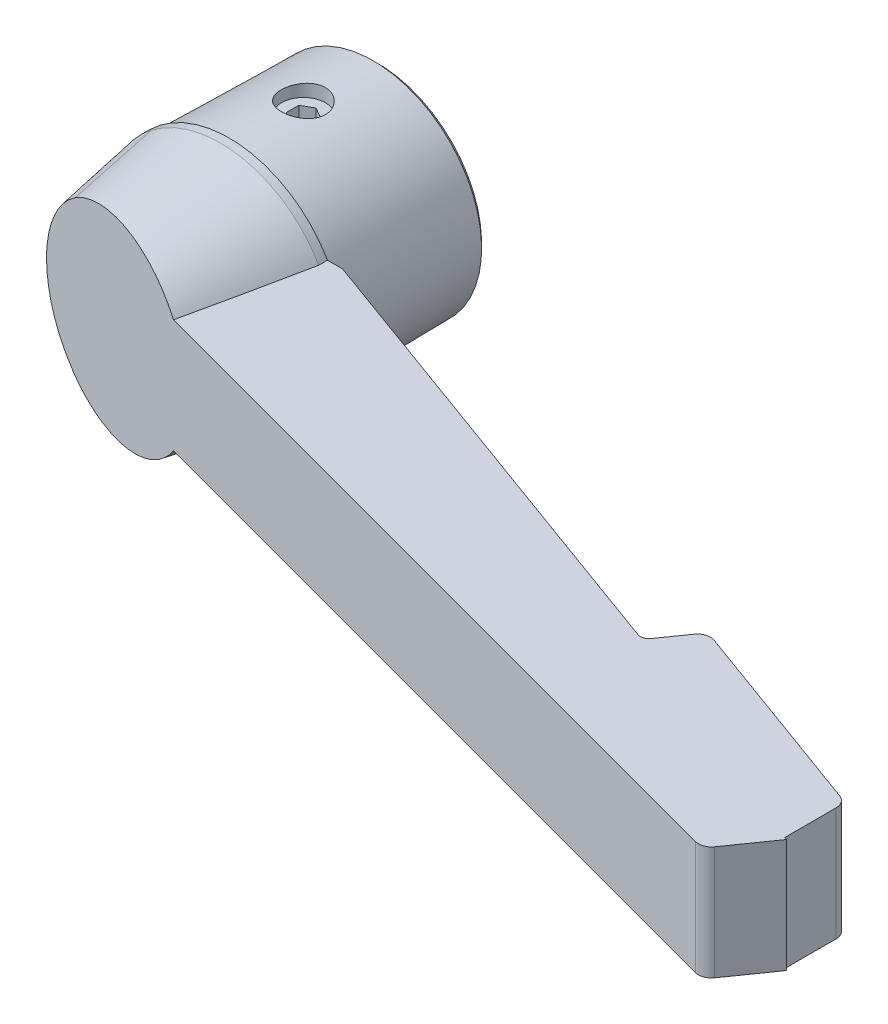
ISO-10303-21;
HEADER;
FILE_DESCRIPTION(('STEP AP214'),'2;1');
FILE_NAME('part.step','',(''),(''),'','','');
FILE_SCHEMA(('AUTOMOTIVE_DESIGN { 1 0 10303 214 1 1 1 1 }'));
ENDSEC;
DATA;
#1=APPLICATION_CONTEXT('core data for automotive mechanical design processes');
#2=APPLICATION_PROTOCOL_DEFINITION('international standard','automotive_design',2000,#1);
#3=PRODUCT_CONTEXT('',#1,'mechanical');
#4=PRODUCT('Part','Part','',(#3));
#5=PRODUCT_RELATED_PRODUCT_CATEGORY('part','',(#4));
#6=PRODUCT_DEFINITION_FORMATION('','',#4);
#7=PRODUCT_DEFINITION_CONTEXT('part definition',#1,'design');
#8=PRODUCT_DEFINITION('design','',#6,#7);
#9=PRODUCT_DEFINITION_SHAPE('','',#8);
#10=(LENGTH_UNIT() NAMED_UNIT(*) SI_UNIT(.MILLI.,.METRE.));
#11=(NAMED_UNIT(*) PLANE_ANGLE_UNIT() SI_UNIT($,.RADIAN.));
#12=(NAMED_UNIT(*) SI_UNIT($,.STERADIAN.) SOLID_ANGLE_UNIT());
#13=UNCERTAINTY_MEASURE_WITH_UNIT(LENGTH_MEASURE(1.E-05),#10,'distance_accuracy_value','');
#14=(GEOMETRIC_REPRESENTATION_CONTEXT(3) GLOBAL_UNCERTAINTY_ASSIGNED_CONTEXT((#13)) GLOBAL_UNIT_ASSIGNED_CONTEXT((#10,
#11,#12)) REPRESENTATION_CONTEXT('',''));
#15=CARTESIAN_POINT('',(0.,0.,0.));
#16=DIRECTION('',(0.,0.,1.));
#17=DIRECTION('',(1.,0.,0.));
#18=AXIS2_PLACEMENT_3D('',#15,#16,#17);
#19=CARTESIAN_POINT('',(0.,20.,8.5));
#20=DIRECTION('',(0.,-1.,0.));
#21=DIRECTION('',(1.,0.,0.));
#22=AXIS2_PLACEMENT_3D('',#19,#20,#21);
#23=CYLINDRICAL_SURFACE('',#22,2.5);
#24=CARTESIAN_POINT('',(0.,5.75,8.5));
#25=DIRECTION('',(0.,-1.,0.));
#26=DIRECTION('',(0.,0.,-1.));
#27=AXIS2_PLACEMENT_3D('',#24,#25,#26);
#28=CIRCLE('',#27,2.5);
#29=CARTESIAN_POINT('',(0.,5.75,6.));
#30=VERTEX_POINT('',#29);
#31=EDGE_CURVE('E259',#30,#30,#28,.T.);
#32=ORIENTED_EDGE('',*,*,#31,.F.);
#33=EDGE_LOOP('',(#32));
#34=FACE_BOUND('',#33,.T.);
#35=CARTESIAN_POINT('',(0.,5.,8.5));
#36=DIRECTION('',(0.,-1.,0.));
#37=DIRECTION('',(1.,0.,0.));
#38=AXIS2_PLACEMENT_3D('',#35,#36,#37);
#39=CIRCLE('',#38,2.5);
#40=CARTESIAN_POINT('',(2.5,5.,8.5));
#41=VERTEX_POINT('',#40);
#42=EDGE_CURVE('E19',#41,#41,#39,.T.);
#43=ORIENTED_EDGE('',*,*,#42,.T.);
#44=EDGE_LOOP('',(#43));
#45=FACE_BOUND('',#44,.T.);
#46=ADVANCED_FACE('F15',(#34,#45),#23,.F.);
#47=CARTESIAN_POINT('',(0.,0.,32.2896880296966));
#48=DIRECTION('',(0.,0.,-1.));
#49=DIRECTION('',(0.,1.,0.));
#50=AXIS2_PLACEMENT_3D('',#47,#48,#49);
#51=CONICAL_SURFACE('',#50,10.4803424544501,0.174532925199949);
#52=CARTESIAN_POINT('',(14.597999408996,-6.5,1.1011440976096));
#53=CARTESIAN_POINT('',(14.4321255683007,-6.5,1.96051042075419));
#54=CARTESIAN_POINT('',(14.2658046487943,-6.5,2.8197904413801));
#55=CARTESIAN_POINT('',(13.9321611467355,-6.5,4.53815645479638));
#56=CARTESIAN_POINT('',(13.7648385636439,-6.5,5.39724244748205));
#57=CARTESIAN_POINT('',(13.2612097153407,-6.5,7.97416365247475));
#58=CARTESIAN_POINT('',(12.9232399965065,-6.5,9.69167430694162));
#59=CARTESIAN_POINT('',(12.2408256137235,-6.5,13.1301467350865));
#60=CARTESIAN_POINT('',(11.8963661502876,-6.5,14.8511055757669));
#61=CARTESIAN_POINT('',(11.2002243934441,-6.5,18.2915870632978));
#62=CARTESIAN_POINT('',(10.84854200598,-6.5,20.0111096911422));
#63=CARTESIAN_POINT('',(10.135682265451,-6.5,23.4479534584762));
#64=CARTESIAN_POINT('',(9.77450619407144,-6.5,25.1652748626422));
#65=CARTESIAN_POINT('',(9.22284580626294,-6.5,27.739106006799));
#66=CARTESIAN_POINT('',(9.03731281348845,-6.5,28.5966769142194));
#67=CARTESIAN_POINT('',(8.66227201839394,-6.5,30.3109496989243));
#68=CARTESIAN_POINT('',(8.47276422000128,-6.5,31.1676515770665));
#69=CARTESIAN_POINT('',(8.08929884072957,-6.5,32.8783309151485));
#70=CARTESIAN_POINT('',(7.89535051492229,-6.5,33.732310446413));
#71=CARTESIAN_POINT('',(7.50152045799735,-6.5,35.4388994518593));
#72=CARTESIAN_POINT('',(7.30163875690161,-6.5,36.2915089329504));
#73=CARTESIAN_POINT('',(6.89432715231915,-6.5,37.9951014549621));
#74=CARTESIAN_POINT('',(6.68689579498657,-6.5,38.846084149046));
#75=CARTESIAN_POINT('',(6.26227756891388,-6.5,40.5456209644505));
#76=CARTESIAN_POINT('',(6.04509079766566,-6.5,41.3941751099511));
#77=CARTESIAN_POINT('',(5.70907006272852,-6.5,42.6654675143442));
#78=CARTESIAN_POINT('',(5.59520353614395,-6.5,43.0895188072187));
#79=CARTESIAN_POINT('',(5.3634876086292,-6.5,43.9365209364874));
#80=CARTESIAN_POINT('',(5.24563832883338,-6.5,44.3594718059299));
#81=CARTESIAN_POINT('',(5.00520679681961,-6.5,45.203763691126));
#82=CARTESIAN_POINT('',(4.88262733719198,-6.5,45.6251055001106));
#83=CARTESIAN_POINT('',(4.63155031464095,-6.5,46.4660760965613));
#84=CARTESIAN_POINT('',(4.50305215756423,-6.5,46.8857047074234));
#85=CARTESIAN_POINT('',(4.23827851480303,-6.5,47.72361936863));
#86=CARTESIAN_POINT('',(4.10198506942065,-6.5,48.1418997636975));
#87=CARTESIAN_POINT('',(3.81967795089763,-6.5,48.9750798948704));
#88=CARTESIAN_POINT('',(3.67366693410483,-6.5,49.3899805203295));
#89=CARTESIAN_POINT('',(3.44448029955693,-6.5,50.009011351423));
#90=CARTESIAN_POINT('',(3.3663112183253,-6.5,50.2149942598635));
#91=CARTESIAN_POINT('',(3.20593602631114,-6.5,50.6253655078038));
#92=CARTESIAN_POINT('',(3.12373029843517,-6.5,50.829753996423));
#93=CARTESIAN_POINT('',(2.95432227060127,-6.5,51.2366831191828));
#94=CARTESIAN_POINT('',(2.86711549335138,-6.5,51.4392219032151));
#95=CARTESIAN_POINT('',(2.73167045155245,-6.5,51.7409882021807));
#96=CARTESIAN_POINT('',(2.68574176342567,-6.5,51.8412528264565));
#97=CARTESIAN_POINT('',(2.59212405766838,-6.5,52.0409654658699));
#98=CARTESIAN_POINT('',(2.54443490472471,-6.5,52.1404134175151));
#99=CARTESIAN_POINT('',(2.49575939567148,-6.5,52.239382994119));
#100=B_SPLINE_CURVE_WITH_KNOTS('',3,(#52,#53,#54,#55,#56,#57,#58,#59,#60,#61,#62,#63,#64,#65,
#66,#67,#68,#69,#70,#71,#72,#73,#74,#75,#76,#77,#78,#79,#80,#81,#82,#83,#84,#85,#86,#87,#88,#89,
#90,#91,#92,#93,#94,#95,#96,#97,#98,#99),.UNSPECIFIED.,.F.,.F.,(4,2,2,2,2,2,2,2,2,2,2,2,2,2,2,2,
2,2,2,2,2,2,2,4),(0.,2.62568474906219,5.25137091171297,10.502705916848,15.7679729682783,
21.033308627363,26.2979370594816,28.9301632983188,31.5623869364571,34.1895501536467,
36.816700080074,39.4443586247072,42.0719909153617,43.3891948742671,44.7063588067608,
46.0227566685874,47.3392869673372,48.6589832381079,49.9783202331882,50.6392362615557,
51.3000897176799,51.9615443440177,52.2923794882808,52.6232401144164),.UNSPECIFIED.);
#101=CARTESIAN_POINT('',(8.34911340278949,-6.5,31.7187949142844));
#102=VERTEX_POINT('',#101);
#103=CARTESIAN_POINT('',(11.2583302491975,-6.5,18.));
#104=VERTEX_POINT('',#103);
#105=EDGE_CURVE('E24',#102,#104,#100,.F.);
#106=ORIENTED_EDGE('',*,*,#105,.F.);
#107=CARTESIAN_POINT('',(-0.519555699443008,0.,29.3431412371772));
#108=DIRECTION('',(-0.258748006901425,0.,0.965944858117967));
#109=DIRECTION('',(-0.965944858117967,0.,-0.258748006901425));
#110=AXIS2_PLACEMENT_3D('',#107,#108,#109);
#111=ELLIPSE('',#110,11.3877081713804,10.9876212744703);
#112=CARTESIAN_POINT('',(-7.48359703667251,-8.50518342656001,27.4776809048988));
#113=VERTEX_POINT('',#112);
#114=EDGE_CURVE('E942',#102,#113,#111,.F.);
#115=ORIENTED_EDGE('',*,*,#114,.T.);
#116=CARTESIAN_POINT('',(0.,-9.20081051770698,24.4192267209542));
#117=DIRECTION('',(0.,0.975096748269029,-0.221779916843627));
#118=DIRECTION('',(0.,-0.221779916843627,-0.975096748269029));
#119=AXIS2_PLACEMENT_3D('',#116,#117,#118);
#120=ELLIPSE('',#119,53.5130380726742,7.49648518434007);
#121=CARTESIAN_POINT('',(-7.43954340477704,-10.6608251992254,18.));
#122=VERTEX_POINT('',#121);
#123=EDGE_CURVE('E794',#113,#122,#120,.F.);
#124=ORIENTED_EDGE('',*,*,#123,.T.);
#125=CARTESIAN_POINT('',(0.,0.,18.));
#126=DIRECTION('',(0.,0.,1.));
#127=DIRECTION('',(0.,-1.,0.));
#128=AXIS2_PLACEMENT_3D('',#125,#126,#127);
#129=CIRCLE('',#128,13.);
#130=EDGE_CURVE('E398',#122,#104,#129,.T.);
#131=ORIENTED_EDGE('',*,*,#130,.T.);
#132=EDGE_LOOP('',(#106,#115,#124,#131));
#133=FACE_BOUND('',#132,.T.);
#134=ADVANCED_FACE('F371',(#133),#51,.T.);
#135=CARTESIAN_POINT('',(-6.63523168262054,8.11241508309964,32.2896880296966));
#136=CARTESIAN_POINT('',(-6.77606274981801,8.35794319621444,30.701944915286));
#137=CARTESIAN_POINT('',(-7.057724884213,8.84899942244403,27.5264586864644));
#138=CARTESIAN_POINT('',(-7.48021808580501,9.58558376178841,22.7632293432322));
#139=CARTESIAN_POINT('',(-7.76188022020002,10.076639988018,19.5877431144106));
#140=CARTESIAN_POINT('',(-7.90271128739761,10.3221681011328,18.));
#141=(BOUNDED_CURVE() B_SPLINE_CURVE(3,(#135,#136,#137,#138,#139,#140),.UNSPECIFIED.,.F.,
.F.) B_SPLINE_CURVE_WITH_KNOTS((4,1,1,4),(0.,0.333333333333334,0.666666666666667,1.),
.UNSPECIFIED.) CURVE() GEOMETRIC_REPRESENTATION_ITEM() RATIONAL_B_SPLINE_CURVE((1.,1.,1.,1.,1.,1.)) REPRESENTATION_ITEM(''));
#142=CARTESIAN_POINT('',(-7.90271128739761,10.3221681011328,18.));
#143=VERTEX_POINT('',#142);
#144=CARTESIAN_POINT('',(-7.05236299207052,8.83867372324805,27.5931958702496));
#145=VERTEX_POINT('',#144);
#146=EDGE_CURVE('E790',#143,#145,#141,.F.);
#147=ORIENTED_EDGE('',*,*,#146,.T.);
#148=CARTESIAN_POINT('',(-0.519555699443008,0.,29.3431412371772));
#149=DIRECTION('',(-0.258748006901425,0.,0.965944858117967));
#150=DIRECTION('',(-0.965944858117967,0.,-0.258748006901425));
#151=AXIS2_PLACEMENT_3D('',#148,#149,#150);
#152=ELLIPSE('',#151,11.3877081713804,10.9876212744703);
#153=CARTESIAN_POINT('',(8.34911340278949,6.5,31.7187949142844));
#154=VERTEX_POINT('',#153);
#155=EDGE_CURVE('E39',#145,#154,#152,.F.);
#156=ORIENTED_EDGE('',*,*,#155,.T.);
#157=CARTESIAN_POINT('',(14.597999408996,6.5,1.1011440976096));
#158=CARTESIAN_POINT('',(14.4321255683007,6.5,1.96051042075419));
#159=CARTESIAN_POINT('',(14.2658046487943,6.5,2.8197904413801));
#160=CARTESIAN_POINT('',(13.9321611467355,6.5,4.53815645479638));
#161=CARTESIAN_POINT('',(13.7648385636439,6.5,5.39724244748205));
#162=CARTESIAN_POINT('',(13.2612097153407,6.5,7.97416365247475));
#163=CARTESIAN_POINT('',(12.9232399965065,6.5,9.69167430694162));
#164=CARTESIAN_POINT('',(12.2408256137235,6.5,13.1301467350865));
#165=CARTESIAN_POINT('',(11.8963661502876,6.5,14.8511055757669));
#166=CARTESIAN_POINT('',(11.2002243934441,6.5,18.2915870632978));
#167=CARTESIAN_POINT('',(10.84854200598,6.5,20.0111096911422));
#168=CARTESIAN_POINT('',(10.135682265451,6.5,23.4479534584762));
#169=CARTESIAN_POINT('',(9.77450619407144,6.5,25.1652748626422));
#170=CARTESIAN_POINT('',(9.22284580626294,6.5,27.739106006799));
#171=CARTESIAN_POINT('',(9.03731281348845,6.5,28.5966769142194));
#172=CARTESIAN_POINT('',(8.66227201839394,6.5,30.3109496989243));
#173=CARTESIAN_POINT('',(8.47276422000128,6.5,31.1676515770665));
#174=CARTESIAN_POINT('',(8.08929884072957,6.5,32.8783309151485));
#175=CARTESIAN_POINT('',(7.89535051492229,6.5,33.732310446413));
#176=CARTESIAN_POINT('',(7.50152045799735,6.5,35.4388994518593));
#177=CARTESIAN_POINT('',(7.30163875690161,6.5,36.2915089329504));
#178=CARTESIAN_POINT('',(6.89432715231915,6.5,37.9951014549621));
#179=CARTESIAN_POINT('',(6.68689579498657,6.5,38.846084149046));
#180=CARTESIAN_POINT('',(6.26227756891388,6.5,40.5456209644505));
#181=CARTESIAN_POINT('',(6.04509079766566,6.5,41.3941751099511));
#182=CARTESIAN_POINT('',(5.70907006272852,6.5,42.6654675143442));
#183=CARTESIAN_POINT('',(5.59520353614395,6.5,43.0895188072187));
#184=CARTESIAN_POINT('',(5.3634876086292,6.5,43.9365209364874));
#185=CARTESIAN_POINT('',(5.24563832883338,6.5,44.3594718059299));
#186=CARTESIAN_POINT('',(5.00520679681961,6.5,45.203763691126));
#187=CARTESIAN_POINT('',(4.88262733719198,6.5,45.6251055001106));
#188=CARTESIAN_POINT('',(4.63155031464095,6.5,46.4660760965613));
#189=CARTESIAN_POINT('',(4.50305215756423,6.5,46.8857047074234));
#190=CARTESIAN_POINT('',(4.23827851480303,6.5,47.72361936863));
#191=CARTESIAN_POINT('',(4.10198506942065,6.5,48.1418997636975));
#192=CARTESIAN_POINT('',(3.81967795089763,6.5,48.9750798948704));
#193=CARTESIAN_POINT('',(3.67366693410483,6.5,49.3899805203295));
#194=CARTESIAN_POINT('',(3.44448029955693,6.5,50.009011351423));
#195=CARTESIAN_POINT('',(3.3663112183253,6.5,50.2149942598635));
#196=CARTESIAN_POINT('',(3.20593602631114,6.5,50.6253655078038));
#197=CARTESIAN_POINT('',(3.12373029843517,6.5,50.829753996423));
#198=CARTESIAN_POINT('',(2.95432227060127,6.5,51.2366831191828));
#199=CARTESIAN_POINT('',(2.86711549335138,6.5,51.4392219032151));
#200=CARTESIAN_POINT('',(2.73167045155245,6.5,51.7409882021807));
#201=CARTESIAN_POINT('',(2.68574176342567,6.5,51.8412528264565));
#202=CARTESIAN_POINT('',(2.59212405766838,6.5,52.0409654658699));
#203=CARTESIAN_POINT('',(2.54443490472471,6.5,52.1404134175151));
#204=CARTESIAN_POINT('',(2.49575939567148,6.5,52.239382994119));
#205=B_SPLINE_CURVE_WITH_KNOTS('',3,(#157,#158,#159,#160,#161,#162,#163,#164,#165,#166,#167,
#168,#169,#170,#171,#172,#173,#174,#175,#176,#177,#178,#179,#180,#181,#182,#183,#184,#185,#186,
#187,#188,#189,#190,#191,#192,#193,#194,#195,#196,#197,#198,#199,#200,#201,#202,#203,#204),
.UNSPECIFIED.,.F.,.F.,(4,2,2,2,2,2,2,2,2,2,2,2,2,2,2,2,2,2,2,2,2,2,2,4),(0.,2.62568474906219,
5.25137091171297,10.502705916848,15.7679729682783,21.033308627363,26.2979370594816,
28.9301632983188,31.5623869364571,34.1895501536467,36.816700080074,39.4443586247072,
42.0719909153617,43.3891948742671,44.7063588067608,46.0227566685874,47.3392869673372,
48.6589832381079,49.9783202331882,50.6392362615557,51.3000897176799,51.9615443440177,
52.2923794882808,52.6232401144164),.UNSPECIFIED.);
#206=CARTESIAN_POINT('',(11.2583302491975,6.5,18.));
#207=VERTEX_POINT('',#206);
#208=EDGE_CURVE('E355',#154,#207,#205,.F.);
#209=ORIENTED_EDGE('',*,*,#208,.T.);
#210=EDGE_CURVE('E387',#207,#143,#129,.T.);
#211=ORIENTED_EDGE('',*,*,#210,.T.);
#212=EDGE_LOOP('',(#147,#156,#209,#211));
#213=FACE_BOUND('',#212,.T.);
#214=ADVANCED_FACE('F338',(#213),#51,.T.);
#215=CARTESIAN_POINT('',(-10.4803424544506,0.,32.2896880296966));
#216=CARTESIAN_POINT('',(-10.760304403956,0.,30.701944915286));
#217=CARTESIAN_POINT('',(-11.320228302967,0.,27.5264586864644));
#218=CARTESIAN_POINT('',(-12.1601141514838,0.,22.7632293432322));
#219=CARTESIAN_POINT('',(-12.7200380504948,0.,19.5877431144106));
#220=CARTESIAN_POINT('',(-13.0000000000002,0.,18.));
#221=CARTESIAN_POINT('',(-10.4803424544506,-0.00278532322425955,32.2896880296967));
#222=CARTESIAN_POINT('',(-10.760304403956,-0.00294268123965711,30.7019449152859));
#223=CARTESIAN_POINT('',(-11.3202283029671,-0.00325546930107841,27.5264586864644));
#224=CARTESIAN_POINT('',(-12.1601141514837,-0.00371877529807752,22.7632293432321));
#225=CARTESIAN_POINT('',(-12.7200380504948,-0.0040237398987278,19.5877431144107));
#226=CARTESIAN_POINT('',(-13.0000000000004,-0.00417526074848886,17.9999999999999));
#227=CARTESIAN_POINT('',(-10.4803369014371,-0.0167152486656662,32.2896880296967));
#228=CARTESIAN_POINT('',(-10.7602886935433,-0.0176596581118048,30.7019996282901));
#229=CARTESIAN_POINT('',(-11.3202019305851,-0.0195369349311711,27.5265681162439));
#230=CARTESIAN_POINT('',(-12.1600862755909,-0.0223181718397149,22.7633387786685));
#231=CARTESIAN_POINT('',(-12.7200188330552,-0.0241492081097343,19.5877978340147));
#232=CARTESIAN_POINT('',(-12.9999899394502,-0.0250589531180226,18.0000000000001));
#233=CARTESIAN_POINT('',(-10.4800697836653,-0.128374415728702,32.2896880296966));
#234=CARTESIAN_POINT('',(-10.7599328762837,-0.135639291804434,30.7023633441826));
#235=CARTESIAN_POINT('',(-11.3197330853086,-0.150085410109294,27.5272957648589));
#236=CARTESIAN_POINT('',(-12.1595449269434,-0.171500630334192,22.7640667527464));
#237=CARTESIAN_POINT('',(-12.7194939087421,-0.185607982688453,19.5881619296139));
#238=CARTESIAN_POINT('',(-12.9995054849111,-0.192619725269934,17.9999999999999));
#239=CARTESIAN_POINT('',(-10.4733111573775,-0.504572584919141,32.2896880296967));
#240=CARTESIAN_POINT('',(-10.7523419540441,-0.533226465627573,30.7035429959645));
#241=CARTESIAN_POINT('',(-11.3106905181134,-0.590270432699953,27.529658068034));
#242=CARTESIAN_POINT('',(-12.1486543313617,-0.674999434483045,22.7664335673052));
#243=CARTESIAN_POINT('',(-12.7075918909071,-0.730925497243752,19.5893468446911));
#244=CARTESIAN_POINT('',(-12.987205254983,-0.758755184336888,18.0000000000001));
#245=CARTESIAN_POINT('',(-10.2775965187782,-3.28879935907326,32.2896880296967));
#246=CARTESIAN_POINT('',(-10.536709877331,-3.48124044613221,30.711141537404));
#247=CARTESIAN_POINT('',(-11.0564092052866,-3.86724382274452,27.5449590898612));
#248=CARTESIAN_POINT('',(-11.8381630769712,-4.44797028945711,22.7818928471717));
#249=CARTESIAN_POINT('',(-12.3608326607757,-4.83629261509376,19.5971300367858));
#250=CARTESIAN_POINT('',(-12.6229366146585,-5.03103965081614,17.9999999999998));
#251=CARTESIAN_POINT('',(-9.10957842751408,-5.71186400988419,32.2896880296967));
#252=CARTESIAN_POINT('',(-9.25931147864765,-6.02582583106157,30.7098347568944));
#253=CARTESIAN_POINT('',(-9.559253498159,-6.65538951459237,27.5423171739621));
#254=CARTESIAN_POINT('',(-10.0094839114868,-7.60235358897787,22.7792075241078));
#255=CARTESIAN_POINT('',(-10.3098528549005,-8.23543957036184,19.5957726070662));
#256=CARTESIAN_POINT('',(-10.4602823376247,-8.5528346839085,18.));
#257=CARTESIAN_POINT('',(-7.41072121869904,-7.41072121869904,32.2896880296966));
#258=CARTESIAN_POINT('',(-7.41392368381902,-7.77184388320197,30.701944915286));
#259=CARTESIAN_POINT('',(-7.42032861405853,-8.49408921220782,27.5264586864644));
#260=CARTESIAN_POINT('',(-7.42993600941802,-9.5774572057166,22.7632293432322));
#261=CARTESIAN_POINT('',(-7.4363409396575,-10.2997025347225,19.5877431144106));
#262=CARTESIAN_POINT('',(-7.43954340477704,-10.6608251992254,18.));
#263=(BOUNDED_SURFACE() B_SPLINE_SURFACE(3,3,((#215,#216,#217,#218,#219,#220),(#221,#222,#223,
#224,#225,#226),(#227,#228,#229,#230,#231,#232),(#233,#234,#235,#236,#237,#238),(#239,#240,#241,
#242,#243,#244),(#245,#246,#247,#248,#249,#250),(#251,#252,#253,#254,#255,#256),(#257,#258,#259,
#260,#261,#262)),.UNSPECIFIED.,.F.,.F.,.F.) B_SPLINE_SURFACE_WITH_KNOTS((4,1,1,1,1,4),(4,1,1,4),
(0.,0.00104166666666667,0.00520833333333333,0.0416666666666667,0.140625,1.),(0.,
0.333333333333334,0.666666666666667,1.),
.UNSPECIFIED.) GEOMETRIC_REPRESENTATION_ITEM() RATIONAL_B_SPLINE_SURFACE(((1.,1.,1.,1.,1.,1.),
(0.999947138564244,0.999944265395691,0.999938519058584,0.999929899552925,0.999924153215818,
0.999921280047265),(0.999683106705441,0.999665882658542,0.999631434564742,0.999579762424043,
0.999545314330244,0.999528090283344),(0.997581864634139,0.997450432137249,0.997187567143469,
0.9967932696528,0.99653040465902,0.99639897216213),(0.99083046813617,0.990332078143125,
0.989335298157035,0.9878401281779,0.98684334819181,0.986344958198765),(0.949550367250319,
0.94680828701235,0.941324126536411,0.933097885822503,0.927613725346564,0.924871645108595),
(0.956389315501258,0.95401895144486,0.949278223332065,0.942167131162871,0.937426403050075,
0.935056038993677),(1.,1.,1.,1.,1.,1.))) REPRESENTATION_ITEM('') SURFACE());
#264=CARTESIAN_POINT('',(-11.519453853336,0.,26.3965944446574));
#265=CARTESIAN_POINT('',(-11.5194657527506,-0.223646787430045,26.3965912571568));
#266=CARTESIAN_POINT('',(-11.5125641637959,-0.447290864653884,26.3984399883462));
#267=CARTESIAN_POINT('',(-11.4850127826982,-0.893625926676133,26.4058201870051));
#268=CARTESIAN_POINT('',(-11.4643656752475,-1.11631708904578,26.411350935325));
#269=CARTESIAN_POINT('',(-11.4094127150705,-1.55980002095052,26.4260712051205));
#270=CARTESIAN_POINT('',(-11.3751122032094,-1.78059249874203,26.4352592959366));
#271=CARTESIAN_POINT('',(-11.2930159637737,-2.21947887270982,26.4572504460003));
#272=CARTESIAN_POINT('',(-11.2452191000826,-2.43757254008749,26.4700538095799));
#273=CARTESIAN_POINT('',(-11.1180077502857,-2.94304200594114,26.5041299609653));
#274=CARTESIAN_POINT('',(-11.0333661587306,-3.22902512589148,26.5268029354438));
#275=CARTESIAN_POINT('',(-10.8410437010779,-3.79260135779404,26.5783204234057));
#276=CARTESIAN_POINT('',(-10.7333584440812,-4.07019285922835,26.6071661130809));
#277=CARTESIAN_POINT('',(-10.495714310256,-4.61534252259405,26.6708239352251));
#278=CARTESIAN_POINT('',(-10.3657298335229,-4.88288871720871,26.70564292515));
#279=CARTESIAN_POINT('',(-10.084634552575,-5.40579090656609,26.7809400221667));
#280=CARTESIAN_POINT('',(-9.93352626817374,-5.66114835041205,26.8214174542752));
#281=CARTESIAN_POINT('',(-9.66564158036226,-6.0743583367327,26.8931758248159));
#282=CARTESIAN_POINT('',(-9.55442233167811,-6.23610713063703,26.9229681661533));
#283=CARTESIAN_POINT('',(-9.32359717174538,-6.55307900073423,26.9847993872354));
#284=CARTESIAN_POINT('',(-9.20399104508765,-6.70830190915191,27.0168383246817));
#285=CARTESIAN_POINT('',(-8.95679912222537,-7.01179144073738,27.0830537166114));
#286=CARTESIAN_POINT('',(-8.8292128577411,-7.16005765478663,27.117230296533));
#287=CARTESIAN_POINT('',(-8.56655118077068,-7.44916801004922,27.1875895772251));
#288=CARTESIAN_POINT('',(-8.43147935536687,-7.59001564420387,27.2237713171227));
#289=CARTESIAN_POINT('',(-8.15423555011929,-7.86399591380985,27.2980367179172));
#290=CARTESIAN_POINT('',(-8.01206386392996,-7.99712886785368,27.3361203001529));
#291=CARTESIAN_POINT('',(-7.72109097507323,-8.25534344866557,27.4140633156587));
#292=CARTESIAN_POINT('',(-7.57229076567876,-8.3804262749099,27.4539224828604));
#293=CARTESIAN_POINT('',(-7.42039284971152,-8.50133267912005,27.494611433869));
#294=B_SPLINE_CURVE_WITH_KNOTS('',3,(#264,#265,#266,#267,#268,#269,#270,#271,#272,#273,#274,
#275,#276,#277,#278,#279,#280,#281,#282,#283,#284,#285,#286,#287,#288,#289,#290,#291,#292,#293),
.UNSPECIFIED.,.F.,.F.,(4,2,2,2,2,2,2,2,2,2,2,2,2,2,4),(0.,0.670821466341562,1.34151195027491,
2.01194033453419,2.68242517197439,3.57862224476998,4.47499023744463,5.37239424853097,
6.26969130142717,6.86505453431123,7.46043306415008,8.05584656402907,8.65097716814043,
9.24608317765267,9.84110030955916),.UNSPECIFIED.);
#295=CARTESIAN_POINT('',(-11.519453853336,0.,26.3965944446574));
#296=VERTEX_POINT('',#295);
#297=CARTESIAN_POINT('',(-7.42039284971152,-8.50133267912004,27.494611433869));
#298=VERTEX_POINT('',#297);
#299=EDGE_CURVE('E319',#296,#298,#294,.T.);
#300=DIRECTION('',(0.173648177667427,0.,0.98480775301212));
#301=VECTOR('',#300,1.);
#302=CARTESIAN_POINT('',(-11.7401712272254,0.,25.1448440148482));
#303=LINE('',#302,#301);
#304=CARTESIAN_POINT('',(-13.0000000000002,0.,18.));
#305=VERTEX_POINT('',#304);
#306=EDGE_CURVE('E799',#305,#296,#303,.T.);
#307=EDGE_CURVE('E402',#305,#122,#129,.T.);
#308=DIRECTION('',(-0.00196675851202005,-0.221779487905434,-0.975094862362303));
#309=VECTOR('',#308,1.);
#310=CARTESIAN_POINT('',(-7.42513231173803,-9.03577320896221,25.1448440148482));
#311=LINE('',#310,#309);
#312=EDGE_CURVE('E795',#298,#122,#311,.T.);
#313=ORIENTED_EDGE('',*,*,#299,.F.);
#314=ORIENTED_EDGE('',*,*,#306,.F.);
#315=ORIENTED_EDGE('',*,*,#307,.T.);
#316=ORIENTED_EDGE('',*,*,#312,.F.);
#317=EDGE_LOOP('',(#313,#314,#315,#316));
#318=FACE_BOUND('',#317,.T.);
#319=ADVANCED_FACE('F331',(#318),#263,.F.);
#320=CARTESIAN_POINT('',(-15.3273379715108,-9.03577320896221,25.1448440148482));
#321=DIRECTION('',(0.,0.975096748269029,-0.221779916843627));
#322=DIRECTION('',(0.,0.221779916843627,0.975096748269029));
#323=AXIS2_PLACEMENT_3D('',#320,#321,#322);
#324=PLANE('',#323);
#325=ORIENTED_EDGE('',*,*,#123,.F.);
#326=DIRECTION('',(0.964276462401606,0.0587490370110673,0.258301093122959));
#327=VECTOR('',#326,1.);
#328=CARTESIAN_POINT('',(-15.3880418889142,-8.9867657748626,25.3603143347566));
#329=LINE('',#328,#327);
#330=EDGE_CURVE('E327',#113,#298,#329,.T.);
#331=ORIENTED_EDGE('',*,*,#330,.T.);
#332=ORIENTED_EDGE('',*,*,#312,.T.);
#333=EDGE_LOOP('',(#325,#331,#332));
#334=FACE_BOUND('',#333,.T.);
#335=ADVANCED_FACE('F337',(#334),#324,.T.);
#336=CARTESIAN_POINT('',(-6.63523168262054,8.11241508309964,32.2896880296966));
#337=CARTESIAN_POINT('',(-6.77606274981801,8.35794319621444,30.701944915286));
#338=CARTESIAN_POINT('',(-7.057724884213,8.84899942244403,27.5264586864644));
#339=CARTESIAN_POINT('',(-7.48021808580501,9.58558376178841,22.7632293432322));
#340=CARTESIAN_POINT('',(-7.76188022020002,10.076639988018,19.5877431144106));
#341=CARTESIAN_POINT('',(-7.90271128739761,10.3221681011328,18.));
#342=CARTESIAN_POINT('',(-8.74219823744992,6.3891044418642,32.2896880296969));
#343=CARTESIAN_POINT('',(-8.95800984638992,6.5891329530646,30.703443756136));
#344=CARTESIAN_POINT('',(-9.38981132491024,6.98939393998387,27.5294592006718));
#345=CARTESIAN_POINT('',(-10.0377434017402,7.59011499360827,22.7662341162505));
#346=CARTESIAN_POINT('',(-10.469851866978,7.99081613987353,19.5892469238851));
#347=CARTESIAN_POINT('',(-10.6859958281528,8.19126944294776,17.9999999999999));
#348=CARTESIAN_POINT('',(-10.2227360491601,3.72144142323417,32.2896880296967));
#349=CARTESIAN_POINT('',(-10.4928924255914,3.84008718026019,30.7036949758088));
#350=CARTESIAN_POINT('',(-11.0335007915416,4.07751112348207,27.5299626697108));
#351=CARTESIAN_POINT('',(-11.8448549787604,4.43384882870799,22.7667391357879));
#352=CARTESIAN_POINT('',(-12.3860533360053,4.67154234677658,19.5894999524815));
#353=CARTESIAN_POINT('',(-12.6568015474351,4.79045587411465,17.9999999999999));
#354=CARTESIAN_POINT('',(-10.4715130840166,0.565699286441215,32.2896880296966));
#355=CARTESIAN_POINT('',(-10.7511005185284,0.583540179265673,30.7022460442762));
#356=CARTESIAN_POINT('',(-11.3103289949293,0.619191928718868,27.52706105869));
#357=CARTESIAN_POINT('',(-12.1492530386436,0.672574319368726,22.7638318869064));
#358=CARTESIAN_POINT('',(-12.708589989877,0.7080990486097,19.5880444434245));
#359=CARTESIAN_POINT('',(-12.9882853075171,0.725846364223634,17.9999999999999));
#360=CARTESIAN_POINT('',(-10.480000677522,0.14375460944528,32.2896880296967));
#361=CARTESIAN_POINT('',(-10.7599363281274,0.148282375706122,30.7020236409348));
#362=CARTESIAN_POINT('',(-11.3198215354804,0.157328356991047,27.5266161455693));
#363=CARTESIAN_POINT('',(-12.1596702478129,0.170868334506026,22.7633868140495));
#364=CARTESIAN_POINT('',(-12.7195833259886,0.17987565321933,19.587821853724));
#365=CARTESIAN_POINT('',(-12.9995468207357,0.18437453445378,17.9999999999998));
#366=CARTESIAN_POINT('',(-10.4803354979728,0.0187091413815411,32.2896880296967));
#367=CARTESIAN_POINT('',(-10.7602953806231,0.0192980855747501,30.7019552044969));
#368=CARTESIAN_POINT('',(-11.3202169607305,0.0204746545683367,27.5264792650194));
#369=CARTESIAN_POINT('',(-12.1601020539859,0.0222355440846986,22.7632499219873));
#370=CARTESIAN_POINT('',(-12.7200272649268,0.0234068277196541,19.5877534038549));
#371=CARTESIAN_POINT('',(-12.9999907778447,0.0239918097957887,17.9999999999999));
#372=CARTESIAN_POINT('',(-10.4803424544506,0.00311740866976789,32.2896880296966));
#373=CARTESIAN_POINT('',(-10.760304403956,0.00321553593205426,30.701944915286));
#374=CARTESIAN_POINT('',(-11.3202283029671,0.00341156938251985,27.5264586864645));
#375=CARTESIAN_POINT('',(-12.1601141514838,0.00370495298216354,22.7632293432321));
#376=CARTESIAN_POINT('',(-12.7200380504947,0.00390009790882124,19.5877431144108));
#377=CARTESIAN_POINT('',(-13.0000000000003,0.00399755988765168,17.9999999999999));
#378=CARTESIAN_POINT('',(-10.4803424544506,0.,32.2896880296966));
#379=CARTESIAN_POINT('',(-10.760304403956,0.,30.701944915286));
#380=CARTESIAN_POINT('',(-11.320228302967,0.,27.5264586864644));
#381=CARTESIAN_POINT('',(-12.1601141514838,0.,22.7632293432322));
#382=CARTESIAN_POINT('',(-12.7200380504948,0.,19.5877431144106));
#383=CARTESIAN_POINT('',(-13.0000000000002,0.,18.));
#384=(BOUNDED_SURFACE() B_SPLINE_SURFACE(3,3,((#336,#337,#338,#339,#340,#341),(#342,#343,#344,
#345,#346,#347),(#348,#349,#350,#351,#352,#353),(#354,#355,#356,#357,#358,#359),(#360,#361,#362,
#363,#364,#365),(#366,#367,#368,#369,#370,#371),(#372,#373,#374,#375,#376,#377),(#378,#379,#380,
#381,#382,#383)),.UNSPECIFIED.,.F.,.F.,.F.) B_SPLINE_SURFACE_WITH_KNOTS((4,1,1,1,1,4),(4,1,1,4),
(0.,0.859375,0.958333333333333,0.994791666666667,0.998958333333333,1.),(0.,0.333333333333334,
0.666666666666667,1.),
.UNSPECIFIED.) GEOMETRIC_REPRESENTATION_ITEM() RATIONAL_B_SPLINE_SURFACE(((1.,1.,1.,1.,1.,1.),
(0.944790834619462,0.944345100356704,0.943453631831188,0.942116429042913,0.941224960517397,
0.940779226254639),(0.936133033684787,0.935617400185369,0.934586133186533,0.933039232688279,
0.932007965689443,0.931492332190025),(0.988391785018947,0.988298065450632,0.988110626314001,
0.987829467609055,0.987642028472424,0.987548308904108),(0.996938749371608,0.996914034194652,
0.996864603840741,0.996790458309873,0.996741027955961,0.996716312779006),(0.999598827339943,
0.999595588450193,0.999589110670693,0.999579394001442,0.999572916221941,0.999569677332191),
(0.999933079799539,0.999932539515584,0.999931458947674,0.99992983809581,0.9999287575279,
0.999928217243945),(1.,1.,1.,1.,1.,1.))) REPRESENTATION_ITEM('') SURFACE());
#385=CARTESIAN_POINT('',(-7.05179181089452,8.83865556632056,27.5933487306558));
#386=CARTESIAN_POINT('',(-7.22782678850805,8.70891054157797,27.5461941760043));
#387=CARTESIAN_POINT('',(-7.40011696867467,8.57382964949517,27.500042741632));
#388=CARTESIAN_POINT('',(-7.73663348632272,8.29334661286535,27.4098999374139));
#389=CARTESIAN_POINT('',(-7.90086086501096,8.14794580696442,27.3659082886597));
#390=CARTESIAN_POINT('',(-8.3809666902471,7.69644314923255,27.2373021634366));
#391=CARTESIAN_POINT('',(-8.68392326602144,7.37529543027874,27.1561490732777));
#392=CARTESIAN_POINT('',(-9.16139182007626,6.8036686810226,27.0282493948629));
#393=CARTESIAN_POINT('',(-9.34644951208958,6.56248403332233,26.9786779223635));
#394=CARTESIAN_POINT('',(-9.69643169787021,6.06479709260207,26.8849280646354));
#395=CARTESIAN_POINT('',(-9.86135263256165,5.80829210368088,26.8407506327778));
#396=CARTESIAN_POINT('',(-10.1696491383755,5.28171690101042,26.7581671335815));
#397=CARTESIAN_POINT('',(-10.3130209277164,5.01164431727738,26.7197620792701));
#398=CARTESIAN_POINT('',(-10.5769823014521,4.459831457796,26.6490546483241));
#399=CARTESIAN_POINT('',(-10.6975752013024,4.17809288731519,26.616751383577));
#400=CARTESIAN_POINT('',(-10.8842611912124,3.68587846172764,26.5667437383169));
#401=CARTESIAN_POINT('',(-10.9561307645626,3.47772726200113,26.5474920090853));
#402=CARTESIAN_POINT('',(-11.0872974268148,3.05718673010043,26.5123563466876));
#403=CARTESIAN_POINT('',(-11.1465933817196,2.84479701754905,26.4964727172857));
#404=CARTESIAN_POINT('',(-11.2523272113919,2.41660906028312,26.4681497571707));
#405=CARTESIAN_POINT('',(-11.298764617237,2.20081069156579,26.455710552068));
#406=CARTESIAN_POINT('',(-11.3786975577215,1.76592373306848,26.4342988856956));
#407=CARTESIAN_POINT('',(-11.4121500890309,1.54682666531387,26.4253379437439));
#408=CARTESIAN_POINT('',(-11.4657357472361,1.10688859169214,26.4109839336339));
#409=CARTESIAN_POINT('',(-11.4858685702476,0.886047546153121,26.4055909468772));
#410=CARTESIAN_POINT('',(-11.5127339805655,0.443471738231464,26.3983944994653));
#411=CARTESIAN_POINT('',(-11.5194652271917,0.221736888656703,26.3965913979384));
#412=CARTESIAN_POINT('',(-11.519453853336,0.,26.3965944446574));
#413=B_SPLINE_CURVE_WITH_KNOTS('',3,(#385,#386,#387,#388,#389,#390,#391,#392,#393,#394,#395,
#396,#397,#398,#399,#400,#401,#402,#403,#404,#405,#406,#407,#408,#409,#410,#411,#412),
.UNSPECIFIED.,.F.,.F.,(4,2,2,2,2,2,2,2,2,2,2,2,2,4),(0.,0.670899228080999,1.3417115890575,
2.68464503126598,3.60774385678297,4.53100560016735,5.4544291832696,6.37771825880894,
7.04047384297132,7.70328917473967,8.36612867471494,9.03114501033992,9.6961765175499,
10.361274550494),.UNSPECIFIED.);
#414=EDGE_CURVE('E9',#145,#296,#413,.T.);
#415=EDGE_CURVE('E397',#143,#305,#129,.T.);
#416=ORIENTED_EDGE('',*,*,#414,.F.);
#417=ORIENTED_EDGE('',*,*,#146,.F.);
#418=ORIENTED_EDGE('',*,*,#415,.T.);
#419=ORIENTED_EDGE('',*,*,#306,.T.);
#420=EDGE_LOOP('',(#416,#417,#418,#419));
#421=FACE_BOUND('',#420,.T.);
#422=ADVANCED_FACE('F307',(#421),#384,.F.);
#423=CARTESIAN_POINT('',(0.,0.,0.));
#424=DIRECTION('',(0.,0.,1.));
#425=DIRECTION('',(0.,-1.,0.));
#426=AXIS2_PLACEMENT_3D('',#423,#424,#425);
#427=PLANE('',#426);
#428=DIRECTION('',(-1.,0.,0.));
#429=VECTOR('',#428,1.);
#430=CARTESIAN_POINT('',(5.,5.,0.));
#431=LINE('',#430,#429);
#432=CARTESIAN_POINT('',(5.,5.,0.));
#433=VERTEX_POINT('',#432);
#434=CARTESIAN_POINT('',(-5.,5.,0.));
#435=VERTEX_POINT('',#434);
#436=EDGE_CURVE('E469',#433,#435,#431,.T.);
#437=ORIENTED_EDGE('',*,*,#436,.T.);
#438=DIRECTION('',(0.,1.,0.));
#439=VECTOR('',#438,1.);
#440=CARTESIAN_POINT('',(-5.,-5.,0.));
#441=LINE('',#440,#439);
#442=CARTESIAN_POINT('',(-5.,-5.,0.));
#443=VERTEX_POINT('',#442);
#444=EDGE_CURVE('E32',#443,#435,#441,.T.);
#445=ORIENTED_EDGE('',*,*,#444,.F.);
#446=DIRECTION('',(1.,0.,0.));
#447=VECTOR('',#446,1.);
#448=CARTESIAN_POINT('',(-5.,-5.,0.));
#449=LINE('',#448,#447);
#450=CARTESIAN_POINT('',(5.,-5.,0.));
#451=VERTEX_POINT('',#450);
#452=EDGE_CURVE('E454',#443,#451,#449,.T.);
#453=ORIENTED_EDGE('',*,*,#452,.T.);
#454=DIRECTION('',(0.,-1.,0.));
#455=VECTOR('',#454,1.);
#456=CARTESIAN_POINT('',(5.,5.,0.));
#457=LINE('',#456,#455);
#458=EDGE_CURVE('E468',#433,#451,#457,.T.);
#459=ORIENTED_EDGE('',*,*,#458,.F.);
#460=EDGE_LOOP('',(#437,#445,#453,#459));
#461=FACE_BOUND('',#460,.T.);
#462=CARTESIAN_POINT('',(0.,0.,0.));
#463=DIRECTION('',(0.,0.,1.));
#464=DIRECTION('',(0.,-1.,0.));
#465=AXIS2_PLACEMENT_3D('',#462,#463,#464);
#466=CIRCLE('',#465,11.9119914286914);
#467=CARTESIAN_POINT('',(0.,-11.9119914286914,0.));
#468=VERTEX_POINT('',#467);
#469=EDGE_CURVE('E364',#468,#468,#466,.T.);
#470=ORIENTED_EDGE('',*,*,#469,.F.);
#471=EDGE_LOOP('',(#470));
#472=FACE_BOUND('',#471,.T.);
#473=ADVANCED_FACE('F17',(#461,#472),#427,.F.);
#474=CARTESIAN_POINT('',(0.,0.,0.));
#475=DIRECTION('',(0.,0.,1.));
#476=DIRECTION('',(0.,-1.,0.));
#477=AXIS2_PLACEMENT_3D('',#474,#475,#476);
#478=CONICAL_SURFACE('',#477,11.9119914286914,0.785398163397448);
#479=CARTESIAN_POINT('',(0.,0.,0.5));
#480=DIRECTION('',(0.,0.,1.));
#481=DIRECTION('',(0.,-1.,0.));
#482=AXIS2_PLACEMENT_3D('',#479,#480,#481);
#483=CIRCLE('',#482,12.4119914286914);
#484=CARTESIAN_POINT('',(0.,-12.4119914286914,0.5));
#485=VERTEX_POINT('',#484);
#486=EDGE_CURVE('E410',#485,#485,#483,.T.);
#487=ORIENTED_EDGE('',*,*,#486,.F.);
#488=EDGE_LOOP('',(#487));
#489=FACE_BOUND('',#488,.T.);
#490=ORIENTED_EDGE('',*,*,#469,.T.);
#491=EDGE_LOOP('',(#490));
#492=FACE_BOUND('',#491,.T.);
#493=ADVANCED_FACE('F417',(#489,#492),#478,.T.);
#494=CARTESIAN_POINT('',(0.,0.,0.5));
#495=DIRECTION('',(0.,0.,1.));
#496=DIRECTION('',(0.,-1.,0.));
#497=AXIS2_PLACEMENT_3D('',#494,#495,#496);
#498=CONICAL_SURFACE('',#497,12.4119914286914,0.0174532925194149);
#499=CARTESIAN_POINT('',(-1.78785663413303,12.3928313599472,6.7525536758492));
#500=CARTESIAN_POINT('',(-1.68983569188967,12.4052026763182,6.65227234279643));
#501=CARTESIAN_POINT('',(-1.58332607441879,12.4177597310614,6.56021814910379));
#502=CARTESIAN_POINT('',(-1.35623658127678,12.4417108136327,6.39515931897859));
#503=CARTESIAN_POINT('',(-1.23564574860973,12.4531039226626,6.32216966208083));
#504=CARTESIAN_POINT('',(-0.983708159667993,12.4733470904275,6.1973763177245));
#505=CARTESIAN_POINT('',(-0.852359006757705,12.4821965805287,6.14557736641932));
#506=CARTESIAN_POINT('',(-0.582667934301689,12.4962761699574,6.06477779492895));
#507=CARTESIAN_POINT('',(-0.444327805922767,12.5015071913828,6.03577136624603));
#508=CARTESIAN_POINT('',(-0.166098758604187,12.5076857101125,6.00163036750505));
#509=CARTESIAN_POINT('',(-0.0262408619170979,12.5086771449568,5.99625092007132));
#510=CARTESIAN_POINT('',(0.252379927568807,12.5063785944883,6.00886558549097));
#511=CARTESIAN_POINT('',(0.391142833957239,12.5030886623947,6.02685940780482));
#512=CARTESIAN_POINT('',(0.662544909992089,12.4926608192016,6.08542709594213));
#513=CARTESIAN_POINT('',(0.795222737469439,12.4855524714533,6.1258275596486));
#514=CARTESIAN_POINT('',(1.05192683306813,12.4683381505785,6.22787945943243));
#515=CARTESIAN_POINT('',(1.17595251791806,12.4582319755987,6.28953232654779));
#516=CARTESIAN_POINT('',(1.41329772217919,12.4360790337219,6.43311038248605));
#517=CARTESIAN_POINT('',(1.52648804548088,12.4240126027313,6.51524605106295));
#518=CARTESIAN_POINT('',(1.7376048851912,12.3994572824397,6.69718251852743));
#519=CARTESIAN_POINT('',(1.83553008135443,12.3869683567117,6.79698484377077));
#520=CARTESIAN_POINT('',(2.01452927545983,12.3629466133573,7.01286693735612));
#521=CARTESIAN_POINT('',(2.09538765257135,12.3514270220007,7.12912716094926));
#522=CARTESIAN_POINT('',(2.23642376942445,12.3310127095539,7.37379258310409));
#523=CARTESIAN_POINT('',(2.29660267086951,12.3221178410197,7.5021970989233));
#524=CARTESIAN_POINT('',(2.39410964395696,12.3082454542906,7.76655506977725));
#525=CARTESIAN_POINT('',(2.43160012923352,12.3032400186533,7.90244708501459));
#526=CARTESIAN_POINT('',(2.48324172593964,12.2978408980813,8.17867885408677));
#527=CARTESIAN_POINT('',(2.49739562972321,12.2974466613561,8.31901807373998));
#528=CARTESIAN_POINT('',(2.50191120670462,12.301492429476,8.59769720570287));
#529=CARTESIAN_POINT('',(2.4926589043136,12.305853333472,8.73603220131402));
#530=CARTESIAN_POINT('',(2.45151132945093,12.3189753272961,9.00907228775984));
#531=CARTESIAN_POINT('',(2.41961574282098,12.3277364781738,9.14377732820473));
#532=CARTESIAN_POINT('',(2.33413571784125,12.3488639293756,9.4060120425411));
#533=CARTESIAN_POINT('',(2.28052171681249,12.361235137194,9.53353166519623));
#534=CARTESIAN_POINT('',(2.15317479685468,12.388378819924,9.77781755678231));
#535=CARTESIAN_POINT('',(2.0794394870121,12.4031515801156,9.89458254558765));
#536=CARTESIAN_POINT('',(1.91228902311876,12.4339464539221,10.1164156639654));
#537=CARTESIAN_POINT('',(1.81852793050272,12.4499869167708,10.2212206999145));
#538=CARTESIAN_POINT('',(1.6147289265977,12.4814417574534,10.413713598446));
#539=CARTESIAN_POINT('',(1.50468995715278,12.4968560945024,10.5014003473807));
#540=CARTESIAN_POINT('',(1.2702812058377,12.5256073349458,10.6578707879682));
#541=CARTESIAN_POINT('',(1.14579844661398,12.5389256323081,10.726488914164));
#542=CARTESIAN_POINT('',(0.886731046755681,12.5619200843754,10.8417518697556));
#543=CARTESIAN_POINT('',(0.752147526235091,12.5715966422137,10.8883991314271));
#544=CARTESIAN_POINT('',(0.478887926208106,12.586155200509,10.9576875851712));
#545=CARTESIAN_POINT('',(0.340306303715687,12.5911084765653,10.9806860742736));
#546=CARTESIAN_POINT('',(0.0611676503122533,12.5959494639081,11.0031697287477));
#547=CARTESIAN_POINT('',(-0.0793891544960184,12.5958377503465,11.002657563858));
#548=CARTESIAN_POINT('',(-0.35596255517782,12.590607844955,10.9783538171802));
#549=CARTESIAN_POINT('',(-0.492015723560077,12.5855745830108,10.9549571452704));
#550=CARTESIAN_POINT('',(-0.758210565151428,12.5711448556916,10.8862136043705));
#551=CARTESIAN_POINT('',(-0.888352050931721,12.5617482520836,10.8408660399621));
#552=CARTESIAN_POINT('',(-1.13990059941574,12.5394767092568,10.729275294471));
#553=CARTESIAN_POINT('',(-1.26125400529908,12.526582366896,10.6629151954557));
#554=CARTESIAN_POINT('',(-1.49122472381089,12.4986271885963,10.5112746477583));
#555=CARTESIAN_POINT('',(-1.59984039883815,12.4835660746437,10.4259917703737));
#556=CARTESIAN_POINT('',(-1.80358014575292,12.4524456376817,10.2368945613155));
#557=CARTESIAN_POINT('',(-1.89838633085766,12.4363722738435,10.1327398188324));
#558=CARTESIAN_POINT('',(-2.06926031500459,12.4051437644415,9.90992021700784));
#559=CARTESIAN_POINT('',(-2.1453271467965,12.3899886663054,9.79125460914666));
#560=CARTESIAN_POINT('',(-2.27698350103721,12.3620472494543,9.54180546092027));
#561=CARTESIAN_POINT('',(-2.33243912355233,12.3492766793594,9.41094936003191));
#562=CARTESIAN_POINT('',(-2.42045827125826,12.3275347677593,9.14145727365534));
#563=CARTESIAN_POINT('',(-2.45302515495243,12.3185628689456,9.00282243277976));
#564=CARTESIAN_POINT('',(-2.49384737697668,12.3053998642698,8.72412842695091));
#565=CARTESIAN_POINT('',(-2.50249329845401,12.3011326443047,8.58413007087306));
#566=CARTESIAN_POINT('',(-2.49626791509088,12.2974184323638,8.30457604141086));
#567=CARTESIAN_POINT('',(-2.48139504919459,12.2979717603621,8.16502039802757));
#568=CARTESIAN_POINT('',(-2.42893915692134,12.3035857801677,7.89231250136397));
#569=CARTESIAN_POINT('',(-2.39166463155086,12.3085856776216,7.75909932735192));
#570=CARTESIAN_POINT('',(-2.29579323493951,12.322240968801,7.50086079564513));
#571=CARTESIAN_POINT('',(-2.23721083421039,12.3308938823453,7.37582994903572));
#572=CARTESIAN_POINT('',(-2.11628574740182,12.3484056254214,7.16488848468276));
#573=CARTESIAN_POINT('',(-2.05793974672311,12.3567548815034,7.0766141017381));
#574=CARTESIAN_POINT('',(-1.93061828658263,12.3743114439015,6.90819024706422));
#575=CARTESIAN_POINT('',(-1.86164247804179,12.3835187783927,6.82804104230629));
#576=CARTESIAN_POINT('',(-1.78785663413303,12.3928313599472,6.7525536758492));
#577=B_SPLINE_CURVE_WITH_KNOTS('',3,(#499,#500,#501,#502,#503,#504,#505,#506,#507,#508,#509,
#510,#511,#512,#513,#514,#515,#516,#517,#518,#519,#520,#521,#522,#523,#524,#525,#526,#527,#528,
#529,#530,#531,#532,#533,#534,#535,#536,#537,#538,#539,#540,#541,#542,#543,#544,#545,#546,#547,
#548,#549,#550,#551,#552,#553,#554,#555,#556,#557,#558,#559,#560,#561,#562,#563,#564,#565,#566,
#567,#568,#569,#570,#571,#572,#573,#574,#575,#576),.UNSPECIFIED.,.T.,.F.,(4,2,2,2,2,2,2,2,2,2,2,
2,2,2,2,2,2,2,2,2,2,2,2,2,2,2,2,2,2,2,2,2,2,2,2,2,2,2,4),(0.,0.421945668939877,
0.844221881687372,1.26659242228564,1.68885529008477,2.10673120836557,2.52460193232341,
2.93928304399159,3.35399208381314,3.77315217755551,4.19234850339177,4.6165600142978,
5.04074769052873,5.46186177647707,5.88292547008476,6.29709024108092,6.71126075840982,
7.12599694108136,7.54078242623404,7.96341542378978,8.38607590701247,8.81229902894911,
9.23847495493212,9.65811295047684,10.0777032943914,10.4901784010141,10.9026665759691,
11.3174914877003,11.7323696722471,12.1556524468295,12.5789570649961,13.0049654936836,
13.4309114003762,13.8498601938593,14.2688367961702,14.6821716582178,15.0952263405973,
15.4128380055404,15.7304601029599),.UNSPECIFIED.);
#578=CARTESIAN_POINT('',(-1.78785663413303,12.3928313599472,6.7525536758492));
#579=VERTEX_POINT('',#578);
#580=EDGE_CURVE('E265',#579,#579,#577,.T.);
#581=ORIENTED_EDGE('',*,*,#580,.T.);
#582=EDGE_LOOP('',(#581));
#583=FACE_BOUND('',#582,.T.);
#584=CARTESIAN_POINT('',(0.,0.,17.));
#585=DIRECTION('',(0.,0.,1.));
#586=DIRECTION('',(0.,-1.,0.));
#587=AXIS2_PLACEMENT_3D('',#584,#585,#586);
#588=CIRCLE('',#587,12.6999999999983);
#589=CARTESIAN_POINT('',(0.,-12.6999999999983,17.));
#590=VERTEX_POINT('',#589);
#591=EDGE_CURVE('E408',#590,#590,#588,.T.);
#592=ORIENTED_EDGE('',*,*,#591,.F.);
#593=EDGE_LOOP('',(#592));
#594=FACE_BOUND('',#593,.T.);
#595=ORIENTED_EDGE('',*,*,#486,.T.);
#596=EDGE_LOOP('',(#595));
#597=FACE_BOUND('',#596,.T.);
#598=ADVANCED_FACE('F274',(#583,#594,#597),#498,.T.);
#599=CARTESIAN_POINT('',(-13.0000000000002,0.,17.));
#600=DIRECTION('',(0.,0.,-1.));
#601=DIRECTION('',(0.,1.,0.));
#602=AXIS2_PLACEMENT_3D('',#599,#600,#601);
#603=PLANE('',#602);
#604=ORIENTED_EDGE('',*,*,#591,.T.);
#605=EDGE_LOOP('',(#604));
#606=FACE_BOUND('',#605,.T.);
#607=DIRECTION('',(1.,0.,0.));
#608=VECTOR('',#607,1.);
#609=CARTESIAN_POINT('',(9.38083151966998,-6.5,17.));
#610=LINE('',#609,#608);
#611=CARTESIAN_POINT('',(11.2583302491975,-6.5,17.));
#612=VERTEX_POINT('',#611);
#613=CARTESIAN_POINT('',(13.,-6.5,17.));
#614=VERTEX_POINT('',#613);
#615=EDGE_CURVE('E852',#612,#614,#610,.T.);
#616=ORIENTED_EDGE('',*,*,#615,.F.);
#617=CARTESIAN_POINT('',(0.,0.,17.));
#618=DIRECTION('',(0.,0.,1.));
#619=DIRECTION('',(0.,-1.,0.));
#620=AXIS2_PLACEMENT_3D('',#617,#618,#619);
#621=CIRCLE('',#620,13.);
#622=CARTESIAN_POINT('',(11.2583302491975,6.5,17.));
#623=VERTEX_POINT('',#622);
#624=EDGE_CURVE('E396',#623,#612,#621,.T.);
#625=ORIENTED_EDGE('',*,*,#624,.F.);
#626=DIRECTION('',(1.,0.,0.));
#627=VECTOR('',#626,1.);
#628=CARTESIAN_POINT('',(9.38083151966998,6.5,17.));
#629=LINE('',#628,#627);
#630=CARTESIAN_POINT('',(13.,6.5,17.));
#631=VERTEX_POINT('',#630);
#632=EDGE_CURVE('E796',#623,#631,#629,.T.);
#633=ORIENTED_EDGE('',*,*,#632,.T.);
#634=DIRECTION('',(0.,1.,0.));
#635=VECTOR('',#634,1.);
#636=CARTESIAN_POINT('',(13.,-6.5,17.));
#637=LINE('',#636,#635);
#638=EDGE_CURVE('E906',#614,#631,#637,.T.);
#639=ORIENTED_EDGE('',*,*,#638,.F.);
#640=EDGE_LOOP('',(#616,#625,#633,#639));
#641=FACE_BOUND('',#640,.T.);
#642=ADVANCED_FACE('F759',(#606,#641),#603,.T.);
#643=CARTESIAN_POINT('',(0.,0.,34.658593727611));
#644=DIRECTION('',(0.,0.,1.));
#645=DIRECTION('',(0.,-1.,0.));
#646=AXIS2_PLACEMENT_3D('',#643,#644,#645);
#647=CYLINDRICAL_SURFACE('',#646,13.);
#648=ORIENTED_EDGE('',*,*,#624,.T.);
#649=DIRECTION('',(0.,0.,1.));
#650=VECTOR('',#649,1.);
#651=CARTESIAN_POINT('',(11.2583302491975,-6.5,34.658593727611));
#652=LINE('',#651,#650);
#653=EDGE_CURVE('E403',#612,#104,#652,.T.);
#654=ORIENTED_EDGE('',*,*,#653,.T.);
#655=ORIENTED_EDGE('',*,*,#130,.F.);
#656=ORIENTED_EDGE('',*,*,#307,.F.);
#657=ORIENTED_EDGE('',*,*,#415,.F.);
#658=ORIENTED_EDGE('',*,*,#210,.F.);
#659=DIRECTION('',(0.,0.,1.));
#660=VECTOR('',#659,1.);
#661=CARTESIAN_POINT('',(11.2583302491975,6.5,34.658593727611));
#662=LINE('',#661,#660);
#663=EDGE_CURVE('E907',#623,#207,#662,.T.);
#664=ORIENTED_EDGE('',*,*,#663,.F.);
#665=EDGE_LOOP('',(#648,#654,#655,#656,#657,#658,#664));
#666=FACE_BOUND('',#665,.T.);
#667=ADVANCED_FACE('F379',(#666),#647,.T.);
#668=CARTESIAN_POINT('',(13.,-6.5,17.));
#669=DIRECTION('',(-0.342020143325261,0.,0.939692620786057));
#670=DIRECTION('',(-0.939692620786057,0.,-0.342020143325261));
#671=AXIS2_PLACEMENT_3D('',#668,#669,#670);
#672=PLANE('',#671);
#673=DIRECTION('',(0.,1.,0.));
#674=VECTOR('',#673,1.);
#675=CARTESIAN_POINT('',(66.159508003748,-6.5,36.348478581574));
#676=LINE('',#675,#674);
#677=CARTESIAN_POINT('',(66.159508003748,-6.5,36.348478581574));
#678=VERTEX_POINT('',#677);
#679=CARTESIAN_POINT('',(66.159508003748,6.5,36.348478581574));
#680=VERTEX_POINT('',#679);
#681=EDGE_CURVE('E904',#678,#680,#676,.T.);
#682=ORIENTED_EDGE('',*,*,#681,.F.);
#683=DIRECTION('',(0.939692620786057,0.,0.342020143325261));
#684=VECTOR('',#683,1.);
#685=CARTESIAN_POINT('',(13.,-6.5,17.));
#686=LINE('',#685,#684);
#687=EDGE_CURVE('E854',#614,#678,#686,.T.);
#688=ORIENTED_EDGE('',*,*,#687,.F.);
#689=ORIENTED_EDGE('',*,*,#638,.T.);
#690=DIRECTION('',(0.939692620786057,0.,0.342020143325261));
#691=VECTOR('',#690,1.);
#692=CARTESIAN_POINT('',(13.,6.5,17.));
#693=LINE('',#692,#691);
#694=EDGE_CURVE('E820',#631,#680,#693,.T.);
#695=ORIENTED_EDGE('',*,*,#694,.T.);
#696=EDGE_LOOP('',(#682,#688,#689,#695));
#697=FACE_BOUND('',#696,.T.);
#698=ADVANCED_FACE('F377',(#697),#672,.F.);
#699=CARTESIAN_POINT('',(66.5015281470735,-6.5,35.4087859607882));
#700=DIRECTION('',(0.,1.,0.));
#701=DIRECTION('',(-1.,0.,0.));
#702=AXIS2_PLACEMENT_3D('',#699,#700,#701);
#703=CYLINDRICAL_SURFACE('',#702,1.00000000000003);
#704=DIRECTION('',(0.,1.,0.));
#705=VECTOR('',#704,1.);
#706=CARTESIAN_POINT('',(67.3206801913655,-6.5,35.9823623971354));
#707=LINE('',#706,#705);
#708=CARTESIAN_POINT('',(67.3206801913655,-6.5,35.9823623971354));
#709=VERTEX_POINT('',#708);
#710=CARTESIAN_POINT('',(67.3206801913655,6.5,35.9823623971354));
#711=VERTEX_POINT('',#710);
#712=EDGE_CURVE('E902',#709,#711,#707,.T.);
#713=ORIENTED_EDGE('',*,*,#712,.F.);
#714=CARTESIAN_POINT('',(66.5015281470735,-6.5,35.4087859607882));
#715=DIRECTION('',(0.,-1.,0.));
#716=DIRECTION('',(1.,0.,0.));
#717=AXIS2_PLACEMENT_3D('',#714,#715,#716);
#718=CIRCLE('',#717,1.00000000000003);
#719=EDGE_CURVE('E857',#709,#678,#718,.T.);
#720=ORIENTED_EDGE('',*,*,#719,.T.);
#721=ORIENTED_EDGE('',*,*,#681,.T.);
#722=CARTESIAN_POINT('',(66.5015281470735,6.5,35.4087859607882));
#723=DIRECTION('',(0.,-1.,0.));
#724=DIRECTION('',(1.,0.,0.));
#725=AXIS2_PLACEMENT_3D('',#722,#723,#724);
#726=CIRCLE('',#725,1.00000000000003);
#727=EDGE_CURVE('E823',#711,#680,#726,.T.);
#728=ORIENTED_EDGE('',*,*,#727,.F.);
#729=EDGE_LOOP('',(#713,#720,#721,#728));
#730=FACE_BOUND('',#729,.T.);
#731=ADVANCED_FACE('F733',(#730),#703,.F.);
#732=CARTESIAN_POINT('',(67.3206801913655,-6.5,35.9823623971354));
#733=DIRECTION('',(0.819152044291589,0.,0.573576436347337));
#734=DIRECTION('',(-0.573576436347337,0.,0.819152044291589));
#735=AXIS2_PLACEMENT_3D('',#732,#733,#734);
#736=PLANE('',#735);
#737=DIRECTION('',(0.,1.,0.));
#738=VECTOR('',#737,1.);
#739=CARTESIAN_POINT('',(69.3398189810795,-6.5,33.0987333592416));
#740=LINE('',#739,#738);
#741=CARTESIAN_POINT('',(69.3398189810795,-6.5,33.0987333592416));
#742=VERTEX_POINT('',#741);
#743=CARTESIAN_POINT('',(69.3398189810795,6.5,33.0987333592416));
#744=VERTEX_POINT('',#743);
#745=EDGE_CURVE('E900',#742,#744,#740,.T.);
#746=ORIENTED_EDGE('',*,*,#745,.F.);
#747=DIRECTION('',(0.573576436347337,0.,-0.819152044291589));
#748=VECTOR('',#747,1.);
#749=CARTESIAN_POINT('',(67.3206801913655,-6.5,35.9823623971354));
#750=LINE('',#749,#748);
#751=EDGE_CURVE('E860',#709,#742,#750,.T.);
#752=ORIENTED_EDGE('',*,*,#751,.F.);
#753=ORIENTED_EDGE('',*,*,#712,.T.);
#754=DIRECTION('',(0.573576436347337,0.,-0.819152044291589));
#755=VECTOR('',#754,1.);
#756=CARTESIAN_POINT('',(67.3206801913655,6.5,35.9823623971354));
#757=LINE('',#756,#755);
#758=EDGE_CURVE('E826',#711,#744,#757,.T.);
#759=ORIENTED_EDGE('',*,*,#758,.T.);
#760=EDGE_LOOP('',(#746,#752,#753,#759));
#761=FACE_BOUND('',#760,.T.);
#762=ADVANCED_FACE('F723',(#761),#736,.F.);
#763=CARTESIAN_POINT('',(70.568547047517,-6.5,33.9590980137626));
#764=DIRECTION('',(0.,1.,0.));
#765=DIRECTION('',(-1.,0.,0.));
#766=AXIS2_PLACEMENT_3D('',#763,#764,#765);
#767=CYLINDRICAL_SURFACE('',#766,1.5);
#768=DIRECTION('',(0.,1.,0.));
#769=VECTOR('',#768,1.);
#770=CARTESIAN_POINT('',(71.0815772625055,-6.5,32.5495590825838));
#771=LINE('',#770,#769);
#772=CARTESIAN_POINT('',(71.0815772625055,-6.5,32.5495590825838));
#773=VERTEX_POINT('',#772);
#774=CARTESIAN_POINT('',(71.0815772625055,6.5,32.5495590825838));
#775=VERTEX_POINT('',#774);
#776=EDGE_CURVE('E898',#773,#775,#771,.T.);
#777=ORIENTED_EDGE('',*,*,#776,.F.);
#778=CARTESIAN_POINT('',(70.568547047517,-6.5,33.9590980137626));
#779=DIRECTION('',(0.,-1.,0.));
#780=DIRECTION('',(1.,0.,0.));
#781=AXIS2_PLACEMENT_3D('',#778,#779,#780);
#782=CIRCLE('',#781,1.5);
#783=EDGE_CURVE('E863',#742,#773,#782,.T.);
#784=ORIENTED_EDGE('',*,*,#783,.F.);
#785=ORIENTED_EDGE('',*,*,#745,.T.);
#786=CARTESIAN_POINT('',(70.568547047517,6.5,33.9590980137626));
#787=DIRECTION('',(0.,-1.,0.));
#788=DIRECTION('',(1.,0.,0.));
#789=AXIS2_PLACEMENT_3D('',#786,#787,#788);
#790=CIRCLE('',#789,1.5);
#791=EDGE_CURVE('E829',#744,#775,#790,.T.);
#792=ORIENTED_EDGE('',*,*,#791,.T.);
#793=EDGE_LOOP('',(#777,#784,#785,#792));
#794=FACE_BOUND('',#793,.T.);
#795=ADVANCED_FACE('F713',(#794),#767,.T.);
#796=CARTESIAN_POINT('',(71.0815772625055,-6.5,32.5495590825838));
#797=DIRECTION('',(-0.342020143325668,0.,0.939692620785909));
#798=DIRECTION('',(-0.939692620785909,0.,-0.342020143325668));
#799=AXIS2_PLACEMENT_3D('',#796,#797,#798);
#800=PLANE('',#799);
#801=DIRECTION('',(0.,1.,0.));
#802=VECTOR('',#801,1.);
#803=CARTESIAN_POINT('',(93.713030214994,-6.5,40.7867343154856));
#804=LINE('',#803,#802);
#805=CARTESIAN_POINT('',(93.713030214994,-6.5,40.7867343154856));
#806=VERTEX_POINT('',#805);
#807=CARTESIAN_POINT('',(93.713030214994,6.5,40.7867343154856));
#808=VERTEX_POINT('',#807);
#809=EDGE_CURVE('E896',#806,#808,#804,.T.);
#810=ORIENTED_EDGE('',*,*,#809,.F.);
#811=DIRECTION('',(0.939692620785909,0.,0.342020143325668));
#812=VECTOR('',#811,1.);
#813=CARTESIAN_POINT('',(71.0815772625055,-6.5,32.5495590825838));
#814=LINE('',#813,#812);
#815=EDGE_CURVE('E866',#773,#806,#814,.T.);
#816=ORIENTED_EDGE('',*,*,#815,.F.);
#817=ORIENTED_EDGE('',*,*,#776,.T.);
#818=DIRECTION('',(0.939692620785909,0.,0.342020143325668));
#819=VECTOR('',#818,1.);
#820=CARTESIAN_POINT('',(71.0815772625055,6.5,32.5495590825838));
#821=LINE('',#820,#819);
#822=EDGE_CURVE('E832',#775,#808,#821,.T.);
#823=ORIENTED_EDGE('',*,*,#822,.T.);
#824=EDGE_LOOP('',(#810,#816,#817,#823));
#825=FACE_BOUND('',#824,.T.);
#826=ADVANCED_FACE('F703',(#825),#800,.F.);
#827=CARTESIAN_POINT('',(93.2000000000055,-6.5,42.1962732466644));
#828=DIRECTION('',(0.,1.,0.));
#829=DIRECTION('',(-1.,0.,0.));
#830=AXIS2_PLACEMENT_3D('',#827,#828,#829);
#831=CYLINDRICAL_SURFACE('',#830,1.5);
#832=DIRECTION('',(0.,1.,0.));
#833=VECTOR('',#832,1.);
#834=CARTESIAN_POINT('',(94.7000000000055,-6.5,42.1962732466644));
#835=LINE('',#834,#833);
#836=CARTESIAN_POINT('',(94.7000000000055,-6.5,42.1962732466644));
#837=VERTEX_POINT('',#836);
#838=CARTESIAN_POINT('',(94.7000000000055,6.5,42.1962732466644));
#839=VERTEX_POINT('',#838);
#840=EDGE_CURVE('E894',#837,#839,#835,.T.);
#841=ORIENTED_EDGE('',*,*,#840,.F.);
#842=CARTESIAN_POINT('',(93.2000000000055,-6.5,42.1962732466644));
#843=DIRECTION('',(0.,-1.,0.));
#844=DIRECTION('',(1.,0.,0.));
#845=AXIS2_PLACEMENT_3D('',#842,#843,#844);
#846=CIRCLE('',#845,1.5);
#847=EDGE_CURVE('E869',#806,#837,#846,.T.);
#848=ORIENTED_EDGE('',*,*,#847,.F.);
#849=ORIENTED_EDGE('',*,*,#809,.T.);
#850=CARTESIAN_POINT('',(93.2000000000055,6.5,42.1962732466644));
#851=DIRECTION('',(0.,-1.,0.));
#852=DIRECTION('',(1.,0.,0.));
#853=AXIS2_PLACEMENT_3D('',#850,#851,#852);
#854=CIRCLE('',#853,1.5);
#855=EDGE_CURVE('E835',#808,#839,#854,.T.);
#856=ORIENTED_EDGE('',*,*,#855,.T.);
#857=EDGE_LOOP('',(#841,#848,#849,#856));
#858=FACE_BOUND('',#857,.T.);
#859=ADVANCED_FACE('F693',(#858),#831,.T.);
#860=CARTESIAN_POINT('',(94.7000000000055,-6.5,42.1962732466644));
#861=DIRECTION('',(-1.,0.,0.));
#862=DIRECTION('',(0.,0.,-1.));
#863=AXIS2_PLACEMENT_3D('',#860,#861,#862);
#864=PLANE('',#863);
#865=DIRECTION('',(0.,1.,0.));
#866=VECTOR('',#865,1.);
#867=CARTESIAN_POINT('',(94.7000000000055,-6.5,48.053637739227));
#868=LINE('',#867,#866);
#869=CARTESIAN_POINT('',(94.7000000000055,-6.5,48.053637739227));
#870=VERTEX_POINT('',#869);
#871=CARTESIAN_POINT('',(94.7000000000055,6.5,48.053637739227));
#872=VERTEX_POINT('',#871);
#873=EDGE_CURVE('E892',#870,#872,#868,.T.);
#874=ORIENTED_EDGE('',*,*,#873,.F.);
#875=DIRECTION('',(0.,0.,1.));
#876=VECTOR('',#875,1.);
#877=CARTESIAN_POINT('',(94.7000000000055,-6.5,42.1962732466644));
#878=LINE('',#877,#876);
#879=EDGE_CURVE('E872',#837,#870,#878,.T.);
#880=ORIENTED_EDGE('',*,*,#879,.F.);
#881=ORIENTED_EDGE('',*,*,#840,.T.);
#882=DIRECTION('',(0.,0.,1.));
#883=VECTOR('',#882,1.);
#884=CARTESIAN_POINT('',(94.7000000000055,6.5,42.1962732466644));
#885=LINE('',#884,#883);
#886=EDGE_CURVE('E838',#839,#872,#885,.T.);
#887=ORIENTED_EDGE('',*,*,#886,.T.);
#888=EDGE_LOOP('',(#874,#880,#881,#887));
#889=FACE_BOUND('',#888,.T.);
#890=ADVANCED_FACE('F683',(#889),#864,.F.);
#891=CARTESIAN_POINT('',(95.0000000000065,-6.5,48.1628288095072));
#892=DIRECTION('',(0.342020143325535,0.,-0.939692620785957));
#893=DIRECTION('',(0.939692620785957,0.,0.342020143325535));
#894=AXIS2_PLACEMENT_3D('',#891,#892,#893);
#895=PLANE('',#894);
#896=DIRECTION('',(0.,1.,0.));
#897=VECTOR('',#896,1.);
#898=CARTESIAN_POINT('',(95.0000000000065,-6.5,48.1628288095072));
#899=LINE('',#898,#897);
#900=CARTESIAN_POINT('',(95.0000000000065,-6.5,48.1628288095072));
#901=VERTEX_POINT('',#900);
#902=CARTESIAN_POINT('',(95.0000000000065,6.5,48.1628288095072));
#903=VERTEX_POINT('',#902);
#904=EDGE_CURVE('E890',#901,#903,#899,.T.);
#905=ORIENTED_EDGE('',*,*,#904,.F.);
#906=DIRECTION('',(-0.939692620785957,0.,-0.342020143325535));
#907=VECTOR('',#906,1.);
#908=CARTESIAN_POINT('',(95.0000000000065,-6.5,48.1628288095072));
#909=LINE('',#908,#907);
#910=EDGE_CURVE('E875',#901,#870,#909,.T.);
#911=ORIENTED_EDGE('',*,*,#910,.T.);
#912=ORIENTED_EDGE('',*,*,#873,.T.);
#913=DIRECTION('',(-0.939692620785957,0.,-0.342020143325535));
#914=VECTOR('',#913,1.);
#915=CARTESIAN_POINT('',(95.0000000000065,6.5,48.1628288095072));
#916=LINE('',#915,#914);
#917=EDGE_CURVE('E841',#903,#872,#916,.T.);
#918=ORIENTED_EDGE('',*,*,#917,.F.);
#919=EDGE_LOOP('',(#905,#911,#912,#918));
#920=FACE_BOUND('',#919,.T.);
#921=ADVANCED_FACE('F673',(#920),#895,.T.);
#922=CARTESIAN_POINT('',(91.612352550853,-6.5,53.0008907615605));
#923=DIRECTION('',(0.819152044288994,0.,0.573576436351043));
#924=DIRECTION('',(-0.573576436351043,0.,0.819152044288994));
#925=AXIS2_PLACEMENT_3D('',#922,#923,#924);
#926=PLANE('',#925);
#927=DIRECTION('',(0.,1.,0.));
#928=VECTOR('',#927,1.);
#929=CARTESIAN_POINT('',(91.612352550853,-6.5,53.0008907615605));
#930=LINE('',#929,#928);
#931=CARTESIAN_POINT('',(91.612352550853,-6.5,53.0008907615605));
#932=VERTEX_POINT('',#931);
#933=CARTESIAN_POINT('',(91.612352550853,6.5,53.0008907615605));
#934=VERTEX_POINT('',#933);
#935=EDGE_CURVE('E888',#932,#934,#930,.T.);
#936=ORIENTED_EDGE('',*,*,#935,.F.);
#937=DIRECTION('',(0.573576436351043,0.,-0.819152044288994));
#938=VECTOR('',#937,1.);
#939=CARTESIAN_POINT('',(91.612352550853,-6.5,53.0008907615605));
#940=LINE('',#939,#938);
#941=EDGE_CURVE('E878',#932,#901,#940,.T.);
#942=ORIENTED_EDGE('',*,*,#941,.T.);
#943=ORIENTED_EDGE('',*,*,#904,.T.);
#944=DIRECTION('',(0.573576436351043,0.,-0.819152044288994));
#945=VECTOR('',#944,1.);
#946=CARTESIAN_POINT('',(91.612352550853,6.5,53.0008907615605));
#947=LINE('',#946,#945);
#948=EDGE_CURVE('E844',#934,#903,#947,.T.);
#949=ORIENTED_EDGE('',*,*,#948,.F.);
#950=EDGE_LOOP('',(#936,#942,#943,#949));
#951=FACE_BOUND('',#950,.T.);
#952=ADVANCED_FACE('F663',(#951),#926,.T.);
#953=CARTESIAN_POINT('',(90.3836244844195,-6.5,52.140526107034));
#954=DIRECTION('',(0.,1.,0.));
#955=DIRECTION('',(-1.,0.,0.));
#956=AXIS2_PLACEMENT_3D('',#953,#954,#955);
#957=CYLINDRICAL_SURFACE('',#956,1.5);
#958=DIRECTION('',(0.,1.,0.));
#959=VECTOR('',#958,1.);
#960=CARTESIAN_POINT('',(89.9955024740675,-6.5,53.589443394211));
#961=LINE('',#960,#959);
#962=CARTESIAN_POINT('',(89.9955024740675,-6.5,53.589443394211));
#963=VERTEX_POINT('',#962);
#964=CARTESIAN_POINT('',(89.9955024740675,6.5,53.589443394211));
#965=VERTEX_POINT('',#964);
#966=EDGE_CURVE('E886',#963,#965,#961,.T.);
#967=ORIENTED_EDGE('',*,*,#966,.F.);
#968=CARTESIAN_POINT('',(90.3836244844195,-6.5,52.140526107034));
#969=DIRECTION('',(0.,-1.,0.));
#970=DIRECTION('',(1.,0.,0.));
#971=AXIS2_PLACEMENT_3D('',#968,#969,#970);
#972=CIRCLE('',#971,1.5);
#973=EDGE_CURVE('E881',#932,#963,#972,.T.);
#974=ORIENTED_EDGE('',*,*,#973,.F.);
#975=ORIENTED_EDGE('',*,*,#935,.T.);
#976=CARTESIAN_POINT('',(90.3836244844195,6.5,52.140526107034));
#977=DIRECTION('',(0.,-1.,0.));
#978=DIRECTION('',(1.,0.,0.));
#979=AXIS2_PLACEMENT_3D('',#976,#977,#978);
#980=CIRCLE('',#979,1.5);
#981=EDGE_CURVE('E847',#934,#965,#980,.T.);
#982=ORIENTED_EDGE('',*,*,#981,.T.);
#983=EDGE_LOOP('',(#967,#974,#975,#982));
#984=FACE_BOUND('',#983,.T.);
#985=ADVANCED_FACE('F350',(#984),#957,.T.);
#986=CARTESIAN_POINT('',(66.5015281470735,6.5,35.4087859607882));
#987=DIRECTION('',(0.,-1.,0.));
#988=DIRECTION('',(1.,0.,0.));
#989=AXIS2_PLACEMENT_3D('',#986,#987,#988);
#990=PLANE('',#989);
#991=ORIENTED_EDGE('',*,*,#632,.F.);
#992=ORIENTED_EDGE('',*,*,#663,.T.);
#993=ORIENTED_EDGE('',*,*,#208,.F.);
#994=DIRECTION('',(-0.96594485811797,0.,-0.258748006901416));
#995=VECTOR('',#994,1.);
#996=CARTESIAN_POINT('',(89.9955024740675,6.5,53.589443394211));
#997=LINE('',#996,#995);
#998=EDGE_CURVE('E850',#965,#154,#997,.T.);
#999=ORIENTED_EDGE('',*,*,#998,.F.);
#1000=ORIENTED_EDGE('',*,*,#981,.F.);
#1001=ORIENTED_EDGE('',*,*,#948,.T.);
#1002=ORIENTED_EDGE('',*,*,#917,.T.);
#1003=ORIENTED_EDGE('',*,*,#886,.F.);
#1004=ORIENTED_EDGE('',*,*,#855,.F.);
#1005=ORIENTED_EDGE('',*,*,#822,.F.);
#1006=ORIENTED_EDGE('',*,*,#791,.F.);
#1007=ORIENTED_EDGE('',*,*,#758,.F.);
#1008=ORIENTED_EDGE('',*,*,#727,.T.);
#1009=ORIENTED_EDGE('',*,*,#694,.F.);
#1010=EDGE_LOOP('',(#991,#992,#993,#999,#1000,#1001,#1002,#1003,#1004,#1005,#1006,#1007,#1008,#1009));
#1011=FACE_BOUND('',#1010,.T.);
#1012=ADVANCED_FACE('F340',(#1011),#990,.F.);
#1013=CARTESIAN_POINT('',(66.5015281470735,-6.5,35.4087859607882));
#1014=DIRECTION('',(0.,-1.,0.));
#1015=DIRECTION('',(1.,0.,0.));
#1016=AXIS2_PLACEMENT_3D('',#1013,#1014,#1015);
#1017=PLANE('',#1016);
#1018=ORIENTED_EDGE('',*,*,#653,.F.);
#1019=ORIENTED_EDGE('',*,*,#615,.T.);
#1020=ORIENTED_EDGE('',*,*,#687,.T.);
#1021=ORIENTED_EDGE('',*,*,#719,.F.);
#1022=ORIENTED_EDGE('',*,*,#751,.T.);
#1023=ORIENTED_EDGE('',*,*,#783,.T.);
#1024=ORIENTED_EDGE('',*,*,#815,.T.);
#1025=ORIENTED_EDGE('',*,*,#847,.T.);
#1026=ORIENTED_EDGE('',*,*,#879,.T.);
#1027=ORIENTED_EDGE('',*,*,#910,.F.);
#1028=ORIENTED_EDGE('',*,*,#941,.F.);
#1029=ORIENTED_EDGE('',*,*,#973,.T.);
#1030=DIRECTION('',(-0.96594485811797,0.,-0.258748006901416));
#1031=VECTOR('',#1030,1.);
#1032=CARTESIAN_POINT('',(89.9955024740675,-6.5,53.589443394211));
#1033=LINE('',#1032,#1031);
#1034=EDGE_CURVE('E884',#963,#102,#1033,.T.);
#1035=ORIENTED_EDGE('',*,*,#1034,.T.);
#1036=ORIENTED_EDGE('',*,*,#105,.T.);
#1037=EDGE_LOOP('',(#1018,#1019,#1020,#1021,#1022,#1023,#1024,#1025,#1026,#1027,#1028,#1029,
#1035,#1036));
#1038=FACE_BOUND('',#1037,.T.);
#1039=ADVANCED_FACE('F349',(#1038),#1017,.T.);
#1040=CARTESIAN_POINT('',(89.9955024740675,-6.5,53.589443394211));
#1041=DIRECTION('',(0.258748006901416,0.,-0.965944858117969));
#1042=DIRECTION('',(0.96594485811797,0.,0.258748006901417));
#1043=AXIS2_PLACEMENT_3D('',#1040,#1041,#1042);
#1044=PLANE('',#1043);
#1045=ORIENTED_EDGE('',*,*,#114,.F.);
#1046=ORIENTED_EDGE('',*,*,#1034,.F.);
#1047=ORIENTED_EDGE('',*,*,#966,.T.);
#1048=ORIENTED_EDGE('',*,*,#998,.T.);
#1049=ORIENTED_EDGE('',*,*,#155,.F.);
#1050=ORIENTED_EDGE('',*,*,#414,.T.);
#1051=ORIENTED_EDGE('',*,*,#299,.T.);
#1052=ORIENTED_EDGE('',*,*,#330,.F.);
#1053=EDGE_LOOP('',(#1045,#1046,#1047,#1048,#1049,#1050,#1051,#1052));
#1054=FACE_BOUND('',#1053,.T.);
#1055=ADVANCED_FACE('F295',(#1054),#1044,.F.);
#1056=CARTESIAN_POINT('',(-5.,-5.,20.));
#1057=DIRECTION('',(-1.,0.,0.));
#1058=DIRECTION('',(0.,-1.,0.));
#1059=AXIS2_PLACEMENT_3D('',#1056,#1057,#1058);
#1060=PLANE('',#1059);
#1061=DIRECTION('',(0.,0.,-1.));
#1062=VECTOR('',#1061,1.);
#1063=CARTESIAN_POINT('',(-5.,-5.,20.));
#1064=LINE('',#1063,#1062);
#1065=CARTESIAN_POINT('',(-5.,-5.,20.));
#1066=VERTEX_POINT('',#1065);
#1067=EDGE_CURVE('E328',#1066,#443,#1064,.T.);
#1068=ORIENTED_EDGE('',*,*,#1067,.T.);
#1069=ORIENTED_EDGE('',*,*,#444,.T.);
#1070=DIRECTION('',(0.,0.,-1.));
#1071=VECTOR('',#1070,1.);
#1072=CARTESIAN_POINT('',(-5.,5.,20.));
#1073=LINE('',#1072,#1071);
#1074=CARTESIAN_POINT('',(-5.,5.,20.));
#1075=VERTEX_POINT('',#1074);
#1076=EDGE_CURVE('E444',#1075,#435,#1073,.T.);
#1077=ORIENTED_EDGE('',*,*,#1076,.F.);
#1078=DIRECTION('',(0.,1.,0.));
#1079=VECTOR('',#1078,1.);
#1080=CARTESIAN_POINT('',(-5.,-5.,20.));
#1081=LINE('',#1080,#1079);
#1082=EDGE_CURVE('E450',#1066,#1075,#1081,.T.);
#1083=ORIENTED_EDGE('',*,*,#1082,.F.);
#1084=EDGE_LOOP('',(#1068,#1069,#1077,#1083));
#1085=FACE_BOUND('',#1084,.T.);
#1086=ADVANCED_FACE('F291',(#1085),#1060,.F.);
#1087=CARTESIAN_POINT('',(-5.,-5.,20.));
#1088=DIRECTION('',(0.,1.,0.));
#1089=DIRECTION('',(-1.,0.,0.));
#1090=AXIS2_PLACEMENT_3D('',#1087,#1088,#1089);
#1091=PLANE('',#1090);
#1092=DIRECTION('',(0.,0.,-1.));
#1093=VECTOR('',#1092,1.);
#1094=CARTESIAN_POINT('',(5.,-5.,20.));
#1095=LINE('',#1094,#1093);
#1096=CARTESIAN_POINT('',(5.,-5.,20.));
#1097=VERTEX_POINT('',#1096);
#1098=EDGE_CURVE('E461',#1097,#451,#1095,.T.);
#1099=ORIENTED_EDGE('',*,*,#1098,.T.);
#1100=ORIENTED_EDGE('',*,*,#452,.F.);
#1101=ORIENTED_EDGE('',*,*,#1067,.F.);
#1102=DIRECTION('',(1.,0.,0.));
#1103=VECTOR('',#1102,1.);
#1104=CARTESIAN_POINT('',(-5.,-5.,20.));
#1105=LINE('',#1104,#1103);
#1106=EDGE_CURVE('E452',#1066,#1097,#1105,.T.);
#1107=ORIENTED_EDGE('',*,*,#1106,.T.);
#1108=EDGE_LOOP('',(#1099,#1100,#1101,#1107));
#1109=FACE_BOUND('',#1108,.T.);
#1110=ADVANCED_FACE('F294',(#1109),#1091,.T.);
#1111=CARTESIAN_POINT('',(5.,5.,20.));
#1112=DIRECTION('',(1.,0.,0.));
#1113=DIRECTION('',(0.,1.,0.));
#1114=AXIS2_PLACEMENT_3D('',#1111,#1112,#1113);
#1115=PLANE('',#1114);
#1116=DIRECTION('',(0.,0.,-1.));
#1117=VECTOR('',#1116,1.);
#1118=CARTESIAN_POINT('',(5.,5.,20.));
#1119=LINE('',#1118,#1117);
#1120=CARTESIAN_POINT('',(5.,5.,20.));
#1121=VERTEX_POINT('',#1120);
#1122=EDGE_CURVE('E445',#1121,#433,#1119,.T.);
#1123=ORIENTED_EDGE('',*,*,#1122,.T.);
#1124=ORIENTED_EDGE('',*,*,#458,.T.);
#1125=ORIENTED_EDGE('',*,*,#1098,.F.);
#1126=DIRECTION('',(0.,-1.,0.));
#1127=VECTOR('',#1126,1.);
#1128=CARTESIAN_POINT('',(5.,5.,20.));
#1129=LINE('',#1128,#1127);
#1130=EDGE_CURVE('E449',#1121,#1097,#1129,.T.);
#1131=ORIENTED_EDGE('',*,*,#1130,.F.);
#1132=EDGE_LOOP('',(#1123,#1124,#1125,#1131));
#1133=FACE_BOUND('',#1132,.T.);
#1134=ADVANCED_FACE('F290',(#1133),#1115,.F.);
#1135=CARTESIAN_POINT('',(5.,5.,20.));
#1136=DIRECTION('',(0.,-1.,0.));
#1137=DIRECTION('',(1.,0.,0.));
#1138=AXIS2_PLACEMENT_3D('',#1135,#1136,#1137);
#1139=PLANE('',#1138);
#1140=ORIENTED_EDGE('',*,*,#42,.F.);
#1141=EDGE_LOOP('',(#1140));
#1142=FACE_BOUND('',#1141,.T.);
#1143=DIRECTION('',(-1.,0.,0.));
#1144=VECTOR('',#1143,1.);
#1145=CARTESIAN_POINT('',(5.,5.,20.));
#1146=LINE('',#1145,#1144);
#1147=EDGE_CURVE('E442',#1121,#1075,#1146,.T.);
#1148=ORIENTED_EDGE('',*,*,#1147,.T.);
#1149=ORIENTED_EDGE('',*,*,#1076,.T.);
#1150=ORIENTED_EDGE('',*,*,#436,.F.);
#1151=ORIENTED_EDGE('',*,*,#1122,.F.);
#1152=EDGE_LOOP('',(#1148,#1149,#1150,#1151));
#1153=FACE_BOUND('',#1152,.T.);
#1154=ADVANCED_FACE('F284',(#1142,#1153),#1139,.T.);
#1155=CARTESIAN_POINT('',(-5.,-5.,20.));
#1156=DIRECTION('',(0.,0.,-1.));
#1157=DIRECTION('',(0.,1.,0.));
#1158=AXIS2_PLACEMENT_3D('',#1155,#1156,#1157);
#1159=PLANE('',#1158);
#1160=ORIENTED_EDGE('',*,*,#1082,.T.);
#1161=ORIENTED_EDGE('',*,*,#1147,.F.);
#1162=ORIENTED_EDGE('',*,*,#1130,.T.);
#1163=ORIENTED_EDGE('',*,*,#1106,.F.);
#1164=EDGE_LOOP('',(#1160,#1161,#1162,#1163));
#1165=FACE_BOUND('',#1164,.T.);
#1166=ADVANCED_FACE('F282',(#1165),#1159,.T.);
#1167=CARTESIAN_POINT('',(0.,11.,8.5));
#1168=DIRECTION('',(0.,-1.,0.));
#1169=DIRECTION('',(0.,0.,-1.));
#1170=AXIS2_PLACEMENT_3D('',#1167,#1168,#1169);
#1171=CIRCLE('',#1170,2.5);
#1172=CARTESIAN_POINT('',(0.,11.,6.));
#1173=VERTEX_POINT('',#1172);
#1174=EDGE_CURVE('E249',#1173,#1173,#1171,.T.);
#1175=ORIENTED_EDGE('',*,*,#1174,.T.);
#1176=EDGE_LOOP('',(#1175));
#1177=FACE_BOUND('',#1176,.T.);
#1178=ORIENTED_EDGE('',*,*,#580,.F.);
#1179=EDGE_LOOP('',(#1178));
#1180=FACE_BOUND('',#1179,.T.);
#1181=ADVANCED_FACE('F277',(#1177,#1180),#23,.F.);
#1182=CARTESIAN_POINT('',(0.,8.,7.05662432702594));
#1183=DIRECTION('',(0.,1.,0.));
#1184=DIRECTION('',(1.,0.,0.));
#1185=AXIS2_PLACEMENT_3D('',#1182,#1183,#1184);
#1186=PLANE('',#1185);
#1187=DIRECTION('',(-0.866025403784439,0.,-0.5));
#1188=VECTOR('',#1187,1.);
#1189=CARTESIAN_POINT('',(1.25,8.,7.77831216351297));
#1190=LINE('',#1189,#1188);
#1191=CARTESIAN_POINT('',(1.25,8.,7.77831216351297));
#1192=VERTEX_POINT('',#1191);
#1193=CARTESIAN_POINT('',(0.,8.,7.05662432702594));
#1194=VERTEX_POINT('',#1193);
#1195=EDGE_CURVE('E202',#1192,#1194,#1190,.T.);
#1196=ORIENTED_EDGE('',*,*,#1195,.T.);
#1197=DIRECTION('',(-0.866025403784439,0.,0.5));
#1198=VECTOR('',#1197,1.);
#1199=CARTESIAN_POINT('',(0.,8.,7.05662432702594));
#1200=LINE('',#1199,#1198);
#1201=CARTESIAN_POINT('',(-1.25,8.,7.77831216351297));
#1202=VERTEX_POINT('',#1201);
#1203=EDGE_CURVE('E213',#1194,#1202,#1200,.T.);
#1204=ORIENTED_EDGE('',*,*,#1203,.T.);
#1205=DIRECTION('',(0.,0.,1.));
#1206=VECTOR('',#1205,1.);
#1207=CARTESIAN_POINT('',(-1.25,8.,7.77831216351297));
#1208=LINE('',#1207,#1206);
#1209=CARTESIAN_POINT('',(-1.25,8.,9.22168783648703));
#1210=VERTEX_POINT('',#1209);
#1211=EDGE_CURVE('E218',#1202,#1210,#1208,.T.);
#1212=ORIENTED_EDGE('',*,*,#1211,.T.);
#1213=DIRECTION('',(0.866025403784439,0.,0.5));
#1214=VECTOR('',#1213,1.);
#1215=CARTESIAN_POINT('',(-1.25,8.,9.22168783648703));
#1216=LINE('',#1215,#1214);
#1217=CARTESIAN_POINT('',(0.,8.,9.94337567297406));
#1218=VERTEX_POINT('',#1217);
#1219=EDGE_CURVE('E230',#1210,#1218,#1216,.T.);
#1220=ORIENTED_EDGE('',*,*,#1219,.T.);
#1221=DIRECTION('',(0.866025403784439,0.,-0.5));
#1222=VECTOR('',#1221,1.);
#1223=CARTESIAN_POINT('',(0.,8.,9.94337567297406));
#1224=LINE('',#1223,#1222);
#1225=CARTESIAN_POINT('',(1.25,8.,9.22168783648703));
#1226=VERTEX_POINT('',#1225);
#1227=EDGE_CURVE('E233',#1218,#1226,#1224,.T.);
#1228=ORIENTED_EDGE('',*,*,#1227,.T.);
#1229=DIRECTION('',(0.,0.,-1.));
#1230=VECTOR('',#1229,1.);
#1231=CARTESIAN_POINT('',(1.25,8.,9.22168783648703));
#1232=LINE('',#1231,#1230);
#1233=EDGE_CURVE('E210',#1226,#1192,#1232,.T.);
#1234=ORIENTED_EDGE('',*,*,#1233,.T.);
#1235=EDGE_LOOP('',(#1196,#1204,#1212,#1220,#1228,#1234));
#1236=FACE_BOUND('',#1235,.T.);
#1237=ADVANCED_FACE('F220',(#1236),#1186,.T.);
#1238=CARTESIAN_POINT('',(0.,8.,7.05662432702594));
#1239=DIRECTION('',(-0.5,0.,-0.866025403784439));
#1240=DIRECTION('',(-0.866025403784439,0.,0.5));
#1241=AXIS2_PLACEMENT_3D('',#1238,#1239,#1240);
#1242=PLANE('',#1241);
#1243=DIRECTION('',(-0.866025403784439,0.,0.5));
#1244=VECTOR('',#1243,1.);
#1245=CARTESIAN_POINT('',(0.,11.,7.05662432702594));
#1246=LINE('',#1245,#1244);
#1247=CARTESIAN_POINT('',(0.,11.,7.05662432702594));
#1248=VERTEX_POINT('',#1247);
#1249=CARTESIAN_POINT('',(-1.25,11.,7.77831216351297));
#1250=VERTEX_POINT('',#1249);
#1251=EDGE_CURVE('E237',#1248,#1250,#1246,.T.);
#1252=ORIENTED_EDGE('',*,*,#1251,.T.);
#1253=DIRECTION('',(0.,1.,0.));
#1254=VECTOR('',#1253,1.);
#1255=CARTESIAN_POINT('',(-1.25,8.,7.77831216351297));
#1256=LINE('',#1255,#1254);
#1257=EDGE_CURVE('E209',#1202,#1250,#1256,.T.);
#1258=ORIENTED_EDGE('',*,*,#1257,.F.);
#1259=ORIENTED_EDGE('',*,*,#1203,.F.);
#1260=DIRECTION('',(0.,1.,0.));
#1261=VECTOR('',#1260,1.);
#1262=CARTESIAN_POINT('',(0.,8.,7.05662432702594));
#1263=LINE('',#1262,#1261);
#1264=EDGE_CURVE('E198',#1194,#1248,#1263,.T.);
#1265=ORIENTED_EDGE('',*,*,#1264,.T.);
#1266=EDGE_LOOP('',(#1252,#1258,#1259,#1265));
#1267=FACE_BOUND('',#1266,.T.);
#1268=ADVANCED_FACE('F214',(#1267),#1242,.F.);
#1269=CARTESIAN_POINT('',(-1.25,8.,7.77831216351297));
#1270=DIRECTION('',(-1.,0.,0.));
#1271=DIRECTION('',(0.,1.,0.));
#1272=AXIS2_PLACEMENT_3D('',#1269,#1270,#1271);
#1273=PLANE('',#1272);
#1274=DIRECTION('',(0.,0.,1.));
#1275=VECTOR('',#1274,1.);
#1276=CARTESIAN_POINT('',(-1.25,11.,7.77831216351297));
#1277=LINE('',#1276,#1275);
#1278=CARTESIAN_POINT('',(-1.25,11.,9.22168783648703));
#1279=VERTEX_POINT('',#1278);
#1280=EDGE_CURVE('E239',#1250,#1279,#1277,.T.);
#1281=ORIENTED_EDGE('',*,*,#1280,.T.);
#1282=DIRECTION('',(0.,1.,0.));
#1283=VECTOR('',#1282,1.);
#1284=CARTESIAN_POINT('',(-1.25,8.,9.22168783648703));
#1285=LINE('',#1284,#1283);
#1286=EDGE_CURVE('E254',#1210,#1279,#1285,.T.);
#1287=ORIENTED_EDGE('',*,*,#1286,.F.);
#1288=ORIENTED_EDGE('',*,*,#1211,.F.);
#1289=ORIENTED_EDGE('',*,*,#1257,.T.);
#1290=EDGE_LOOP('',(#1281,#1287,#1288,#1289));
#1291=FACE_BOUND('',#1290,.T.);
#1292=ADVANCED_FACE('F495',(#1291),#1273,.F.);
#1293=CARTESIAN_POINT('',(-1.25,8.,9.22168783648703));
#1294=DIRECTION('',(-0.5,0.,0.866025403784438));
#1295=DIRECTION('',(0.866025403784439,0.,0.5));
#1296=AXIS2_PLACEMENT_3D('',#1293,#1294,#1295);
#1297=PLANE('',#1296);
#1298=DIRECTION('',(0.866025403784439,0.,0.5));
#1299=VECTOR('',#1298,1.);
#1300=CARTESIAN_POINT('',(-1.25,11.,9.22168783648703));
#1301=LINE('',#1300,#1299);
#1302=CARTESIAN_POINT('',(0.,11.,9.94337567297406));
#1303=VERTEX_POINT('',#1302);
#1304=EDGE_CURVE('E242',#1279,#1303,#1301,.T.);
#1305=ORIENTED_EDGE('',*,*,#1304,.T.);
#1306=DIRECTION('',(0.,1.,0.));
#1307=VECTOR('',#1306,1.);
#1308=CARTESIAN_POINT('',(0.,8.,9.94337567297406));
#1309=LINE('',#1308,#1307);
#1310=EDGE_CURVE('E252',#1218,#1303,#1309,.T.);
#1311=ORIENTED_EDGE('',*,*,#1310,.F.);
#1312=ORIENTED_EDGE('',*,*,#1219,.F.);
#1313=ORIENTED_EDGE('',*,*,#1286,.T.);
#1314=EDGE_LOOP('',(#1305,#1311,#1312,#1313));
#1315=FACE_BOUND('',#1314,.T.);
#1316=ADVANCED_FACE('F498',(#1315),#1297,.F.);
#1317=CARTESIAN_POINT('',(0.,8.,9.94337567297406));
#1318=DIRECTION('',(0.5,0.,0.866025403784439));
#1319=DIRECTION('',(0.866025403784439,0.,-0.5));
#1320=AXIS2_PLACEMENT_3D('',#1317,#1318,#1319);
#1321=PLANE('',#1320);
#1322=DIRECTION('',(0.866025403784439,0.,-0.5));
#1323=VECTOR('',#1322,1.);
#1324=CARTESIAN_POINT('',(0.,11.,9.94337567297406));
#1325=LINE('',#1324,#1323);
#1326=CARTESIAN_POINT('',(1.25,11.,9.22168783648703));
#1327=VERTEX_POINT('',#1326);
#1328=EDGE_CURVE('E226',#1303,#1327,#1325,.T.);
#1329=ORIENTED_EDGE('',*,*,#1328,.T.);
#1330=DIRECTION('',(0.,1.,0.));
#1331=VECTOR('',#1330,1.);
#1332=CARTESIAN_POINT('',(1.25,8.,9.22168783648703));
#1333=LINE('',#1332,#1331);
#1334=EDGE_CURVE('E250',#1226,#1327,#1333,.T.);
#1335=ORIENTED_EDGE('',*,*,#1334,.F.);
#1336=ORIENTED_EDGE('',*,*,#1227,.F.);
#1337=ORIENTED_EDGE('',*,*,#1310,.T.);
#1338=EDGE_LOOP('',(#1329,#1335,#1336,#1337));
#1339=FACE_BOUND('',#1338,.T.);
#1340=ADVANCED_FACE('F502',(#1339),#1321,.F.);
#1341=CARTESIAN_POINT('',(1.25,8.,9.22168783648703));
#1342=DIRECTION('',(1.,0.,0.));
#1343=DIRECTION('',(0.,0.,-1.));
#1344=AXIS2_PLACEMENT_3D('',#1341,#1342,#1343);
#1345=PLANE('',#1344);
#1346=DIRECTION('',(0.,0.,-1.));
#1347=VECTOR('',#1346,1.);
#1348=CARTESIAN_POINT('',(1.25,11.,9.22168783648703));
#1349=LINE('',#1348,#1347);
#1350=CARTESIAN_POINT('',(1.25,11.,7.77831216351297));
#1351=VERTEX_POINT('',#1350);
#1352=EDGE_CURVE('E223',#1327,#1351,#1349,.T.);
#1353=ORIENTED_EDGE('',*,*,#1352,.T.);
#1354=DIRECTION('',(0.,1.,0.));
#1355=VECTOR('',#1354,1.);
#1356=CARTESIAN_POINT('',(1.25,8.,7.77831216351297));
#1357=LINE('',#1356,#1355);
#1358=EDGE_CURVE('E247',#1192,#1351,#1357,.T.);
#1359=ORIENTED_EDGE('',*,*,#1358,.F.);
#1360=ORIENTED_EDGE('',*,*,#1233,.F.);
#1361=ORIENTED_EDGE('',*,*,#1334,.T.);
#1362=EDGE_LOOP('',(#1353,#1359,#1360,#1361));
#1363=FACE_BOUND('',#1362,.T.);
#1364=ADVANCED_FACE('F489',(#1363),#1345,.F.);
#1365=CARTESIAN_POINT('',(1.25,8.,7.77831216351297));
#1366=DIRECTION('',(0.5,0.,-0.866025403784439));
#1367=DIRECTION('',(-0.866025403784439,0.,-0.5));
#1368=AXIS2_PLACEMENT_3D('',#1365,#1366,#1367);
#1369=PLANE('',#1368);
#1370=DIRECTION('',(-0.866025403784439,0.,-0.5));
#1371=VECTOR('',#1370,1.);
#1372=CARTESIAN_POINT('',(1.25,11.,7.77831216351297));
#1373=LINE('',#1372,#1371);
#1374=EDGE_CURVE('E205',#1351,#1248,#1373,.T.);
#1375=ORIENTED_EDGE('',*,*,#1374,.T.);
#1376=ORIENTED_EDGE('',*,*,#1264,.F.);
#1377=ORIENTED_EDGE('',*,*,#1195,.F.);
#1378=ORIENTED_EDGE('',*,*,#1358,.T.);
#1379=EDGE_LOOP('',(#1375,#1376,#1377,#1378));
#1380=FACE_BOUND('',#1379,.T.);
#1381=ADVANCED_FACE('F200',(#1380),#1369,.F.);
#1382=CARTESIAN_POINT('',(0.,11.,6.));
#1383=DIRECTION('',(0.,1.,0.));
#1384=DIRECTION('',(0.,0.,1.));
#1385=AXIS2_PLACEMENT_3D('',#1382,#1383,#1384);
#1386=PLANE('',#1385);
#1387=ORIENTED_EDGE('',*,*,#1374,.F.);
#1388=ORIENTED_EDGE('',*,*,#1352,.F.);
#1389=ORIENTED_EDGE('',*,*,#1328,.F.);
#1390=ORIENTED_EDGE('',*,*,#1304,.F.);
#1391=ORIENTED_EDGE('',*,*,#1280,.F.);
#1392=ORIENTED_EDGE('',*,*,#1251,.F.);
#1393=EDGE_LOOP('',(#1387,#1388,#1389,#1390,#1391,#1392));
#1394=FACE_BOUND('',#1393,.T.);
#1395=ORIENTED_EDGE('',*,*,#1174,.F.);
#1396=EDGE_LOOP('',(#1395));
#1397=FACE_BOUND('',#1396,.T.);
#1398=ADVANCED_FACE('F478',(#1394,#1397),#1386,.T.);
#1399=CARTESIAN_POINT('',(0.,5.,8.5));
#1400=DIRECTION('',(0.,-1.,0.));
#1401=DIRECTION('',(0.,0.,-1.));
#1402=AXIS2_PLACEMENT_3D('',#1399,#1400,#1401);
#1403=PLANE('',#1402);
#1404=CARTESIAN_POINT('',(0.,5.,8.5));
#1405=DIRECTION('',(0.,-1.,0.));
#1406=DIRECTION('',(0.,0.,-1.));
#1407=AXIS2_PLACEMENT_3D('',#1404,#1405,#1406);
#1408=CIRCLE('',#1407,1.75);
#1409=CARTESIAN_POINT('',(0.,5.,6.75));
#1410=VERTEX_POINT('',#1409);
#1411=EDGE_CURVE('E262',#1410,#1410,#1408,.T.);
#1412=ORIENTED_EDGE('',*,*,#1411,.T.);
#1413=EDGE_LOOP('',(#1412));
#1414=FACE_BOUND('',#1413,.T.);
#1415=ADVANCED_FACE('F285',(#1414),#1403,.T.);
#1416=CARTESIAN_POINT('',(0.,5.,8.5));
#1417=DIRECTION('',(0.,1.,0.));
#1418=DIRECTION('',(0.,0.,1.));
#1419=AXIS2_PLACEMENT_3D('',#1416,#1417,#1418);
#1420=CONICAL_SURFACE('',#1419,1.75,0.78539816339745);
#1421=ORIENTED_EDGE('',*,*,#31,.T.);
#1422=EDGE_LOOP('',(#1421));
#1423=FACE_BOUND('',#1422,.T.);
#1424=ORIENTED_EDGE('',*,*,#1411,.F.);
#1425=EDGE_LOOP('',(#1424));
#1426=FACE_BOUND('',#1425,.T.);
#1427=ADVANCED_FACE('F472',(#1423,#1426),#1420,.T.);
#1428=CLOSED_SHELL('',(#46,#134,#214,#319,#335,#422,#473,#493,#598,#642,#667,#698,#731,#762,
#795,#826,#859,#890,#921,#952,#985,#1012,#1039,#1055,#1086,#1110,#1134,#1154,#1166,#1181,#1237,
#1268,#1292,#1316,#1340,#1364,#1381,#1398,#1415,#1427));
#1429=MANIFOLD_SOLID_BREP('B1',#1428);
#1430=ADVANCED_BREP_SHAPE_REPRESENTATION('',(#18,#1429),#14);
#1431=SHAPE_DEFINITION_REPRESENTATION(#9,#1430);
ENDSEC;
END-ISO-10303-21;
